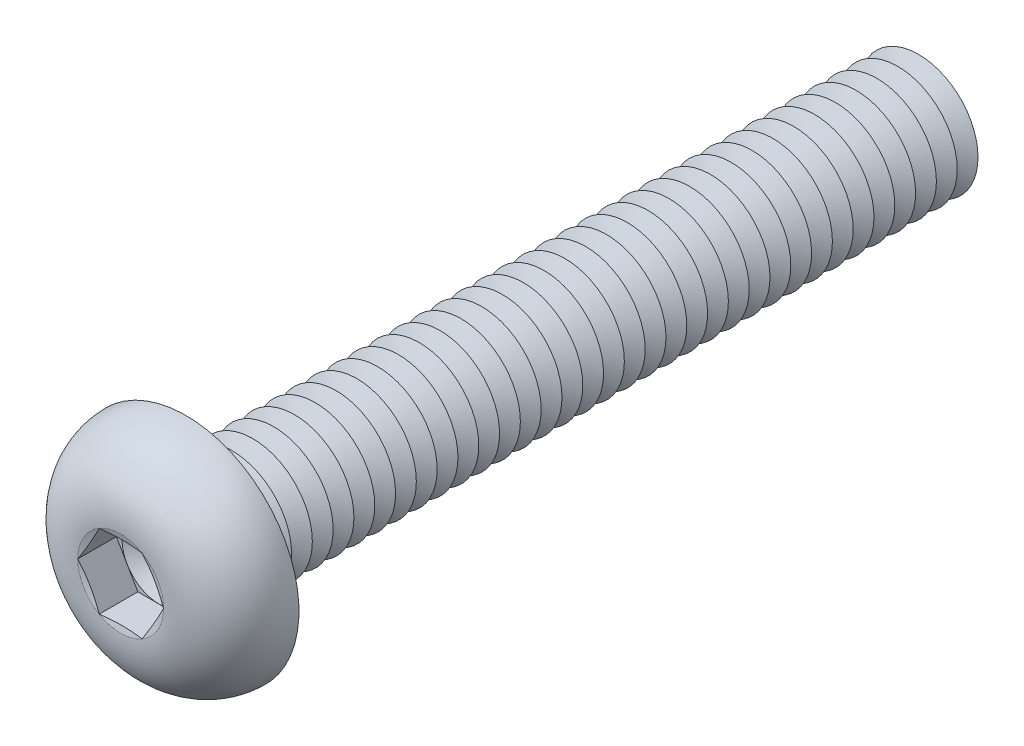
ISO-10303-21;
HEADER;
FILE_DESCRIPTION(('STEP AP214'),'2;1');
FILE_NAME('part.step','',(''),(''),'','','');
FILE_SCHEMA(('AUTOMOTIVE_DESIGN { 1 0 10303 214 1 1 1 1 }'));
ENDSEC;
DATA;
#1=APPLICATION_CONTEXT('core data for automotive mechanical design processes');
#2=APPLICATION_PROTOCOL_DEFINITION('international standard','automotive_design',2000,#1);
#3=PRODUCT_CONTEXT('',#1,'mechanical');
#4=PRODUCT('Part','Part','',(#3));
#5=PRODUCT_RELATED_PRODUCT_CATEGORY('part','',(#4));
#6=PRODUCT_DEFINITION_FORMATION('','',#4);
#7=PRODUCT_DEFINITION_CONTEXT('part definition',#1,'design');
#8=PRODUCT_DEFINITION('design','',#6,#7);
#9=PRODUCT_DEFINITION_SHAPE('','',#8);
#10=(LENGTH_UNIT() NAMED_UNIT(*) SI_UNIT(.MILLI.,.METRE.));
#11=(NAMED_UNIT(*) PLANE_ANGLE_UNIT() SI_UNIT($,.RADIAN.));
#12=(NAMED_UNIT(*) SI_UNIT($,.STERADIAN.) SOLID_ANGLE_UNIT());
#13=UNCERTAINTY_MEASURE_WITH_UNIT(LENGTH_MEASURE(1.E-05),#10,'distance_accuracy_value','');
#14=(GEOMETRIC_REPRESENTATION_CONTEXT(3) GLOBAL_UNCERTAINTY_ASSIGNED_CONTEXT((#13)) GLOBAL_UNIT_ASSIGNED_CONTEXT((#10,
#11,#12)) REPRESENTATION_CONTEXT('',''));
#15=CARTESIAN_POINT('',(0.,0.,0.));
#16=DIRECTION('',(0.,0.,1.));
#17=DIRECTION('',(1.,0.,0.));
#18=AXIS2_PLACEMENT_3D('',#15,#16,#17);
#19=CARTESIAN_POINT('',(0.,0.,0.9));
#20=DIRECTION('',(0.,0.,1.));
#21=DIRECTION('',(1.,0.,0.));
#22=AXIS2_PLACEMENT_3D('',#19,#20,#21);
#23=PLANE('',#22);
#24=CARTESIAN_POINT('',(0.,0.,0.9));
#25=DIRECTION('',(0.,0.,1.));
#26=DIRECTION('',(1.,0.,0.));
#27=AXIS2_PLACEMENT_3D('',#24,#25,#26);
#28=CIRCLE('',#27,1.24999941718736);
#29=CARTESIAN_POINT('',(1.08253125,0.624999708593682,0.9));
#30=VERTEX_POINT('',#29);
#31=CARTESIAN_POINT('',(0.,1.24999941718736,0.9));
#32=VERTEX_POINT('',#31);
#33=EDGE_CURVE('E118',#30,#32,#28,.T.);
#34=ORIENTED_EDGE('',*,*,#33,.F.);
#35=DIRECTION('',(-0.5,0.866025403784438,0.));
#36=VECTOR('',#35,1.);
#37=CARTESIAN_POINT('',(1.443375,0.,0.9));
#38=LINE('',#37,#36);
#39=CARTESIAN_POINT('',(0.7216875,1.24999941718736,0.9));
#40=VERTEX_POINT('',#39);
#41=EDGE_CURVE('E125',#30,#40,#38,.T.);
#42=ORIENTED_EDGE('',*,*,#41,.T.);
#43=DIRECTION('',(-1.,0.,0.));
#44=VECTOR('',#43,1.);
#45=CARTESIAN_POINT('',(0.7216875,1.24999941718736,0.9));
#46=LINE('',#45,#44);
#47=EDGE_CURVE('E136',#40,#32,#46,.T.);
#48=ORIENTED_EDGE('',*,*,#47,.T.);
#49=EDGE_LOOP('',(#34,#42,#48));
#50=FACE_BOUND('',#49,.T.);
#51=ADVANCED_FACE('F39',(#50),#23,.T.);
#52=CARTESIAN_POINT('',(0.,0.,0.9));
#53=DIRECTION('',(0.,0.,1.));
#54=DIRECTION('',(1.,0.,0.));
#55=AXIS2_PLACEMENT_3D('',#52,#53,#54);
#56=CIRCLE('',#55,1.24999941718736);
#57=CARTESIAN_POINT('',(-1.08253125,0.624999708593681,0.9));
#58=VERTEX_POINT('',#57);
#59=EDGE_CURVE('E11',#32,#58,#56,.T.);
#60=ORIENTED_EDGE('',*,*,#59,.F.);
#61=CARTESIAN_POINT('',(-0.721687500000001,1.24999941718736,0.9));
#62=VERTEX_POINT('',#61);
#63=EDGE_CURVE('E131',#32,#62,#46,.T.);
#64=ORIENTED_EDGE('',*,*,#63,.T.);
#65=DIRECTION('',(-0.5,-0.866025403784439,0.));
#66=VECTOR('',#65,1.);
#67=CARTESIAN_POINT('',(-0.721687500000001,1.24999941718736,0.9));
#68=LINE('',#67,#66);
#69=EDGE_CURVE('E134',#62,#58,#68,.T.);
#70=ORIENTED_EDGE('',*,*,#69,.T.);
#71=EDGE_LOOP('',(#60,#64,#70));
#72=FACE_BOUND('',#71,.T.);
#73=ADVANCED_FACE('F130',(#72),#23,.T.);
#74=CARTESIAN_POINT('',(-1.08253125,-0.624999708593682,0.9));
#75=VERTEX_POINT('',#74);
#76=EDGE_CURVE('E49',#58,#75,#56,.T.);
#77=ORIENTED_EDGE('',*,*,#76,.F.);
#78=CARTESIAN_POINT('',(-1.443375,0.,0.9));
#79=VERTEX_POINT('',#78);
#80=EDGE_CURVE('E143',#58,#79,#68,.T.);
#81=ORIENTED_EDGE('',*,*,#80,.T.);
#82=DIRECTION('',(0.5,-0.866025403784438,0.));
#83=VECTOR('',#82,1.);
#84=CARTESIAN_POINT('',(-1.443375,0.,0.9));
#85=LINE('',#84,#83);
#86=EDGE_CURVE('E151',#79,#75,#85,.T.);
#87=ORIENTED_EDGE('',*,*,#86,.T.);
#88=EDGE_LOOP('',(#77,#81,#87));
#89=FACE_BOUND('',#88,.T.);
#90=ADVANCED_FACE('F554',(#89),#23,.T.);
#91=CARTESIAN_POINT('',(0.,-1.24999941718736,0.9));
#92=VERTEX_POINT('',#91);
#93=EDGE_CURVE('E536',#75,#92,#56,.T.);
#94=ORIENTED_EDGE('',*,*,#93,.F.);
#95=CARTESIAN_POINT('',(-0.721687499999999,-1.24999941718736,0.9));
#96=VERTEX_POINT('',#95);
#97=EDGE_CURVE('E150',#75,#96,#85,.T.);
#98=ORIENTED_EDGE('',*,*,#97,.T.);
#99=DIRECTION('',(1.,0.,0.));
#100=VECTOR('',#99,1.);
#101=CARTESIAN_POINT('',(-0.721687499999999,-1.24999941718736,0.9));
#102=LINE('',#101,#100);
#103=EDGE_CURVE('E156',#96,#92,#102,.T.);
#104=ORIENTED_EDGE('',*,*,#103,.T.);
#105=EDGE_LOOP('',(#94,#98,#104));
#106=FACE_BOUND('',#105,.T.);
#107=ADVANCED_FACE('F547',(#106),#23,.T.);
#108=CARTESIAN_POINT('',(1.08253125,-0.624999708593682,0.9));
#109=VERTEX_POINT('',#108);
#110=EDGE_CURVE('E56',#92,#109,#56,.T.);
#111=ORIENTED_EDGE('',*,*,#110,.F.);
#112=CARTESIAN_POINT('',(0.721687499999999,-1.24999941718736,0.9));
#113=VERTEX_POINT('',#112);
#114=EDGE_CURVE('E155',#92,#113,#102,.T.);
#115=ORIENTED_EDGE('',*,*,#114,.T.);
#116=DIRECTION('',(0.5,0.866025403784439,0.));
#117=VECTOR('',#116,1.);
#118=CARTESIAN_POINT('',(0.721687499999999,-1.24999941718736,0.9));
#119=LINE('',#118,#117);
#120=EDGE_CURVE('E161',#113,#109,#119,.T.);
#121=ORIENTED_EDGE('',*,*,#120,.T.);
#122=EDGE_LOOP('',(#111,#115,#121));
#123=FACE_BOUND('',#122,.T.);
#124=ADVANCED_FACE('F627',(#123),#23,.T.);
#125=CARTESIAN_POINT('',(0.,0.,2.2));
#126=DIRECTION('',(0.,0.,1.));
#127=DIRECTION('',(1.,0.,0.));
#128=AXIS2_PLACEMENT_3D('',#125,#126,#127);
#129=CONICAL_SURFACE('',#128,1.443375,1.30899693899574);
#130=CARTESIAN_POINT('',(1.44349047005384,-0.000199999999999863,2.20003094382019));
#131=CARTESIAN_POINT('',(1.41351104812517,0.0517258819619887,2.19199301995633));
#132=CARTESIAN_POINT('',(1.38347725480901,0.10374593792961,2.18469579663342));
#133=CARTESIAN_POINT('',(1.32330355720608,0.207969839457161,2.17187512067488));
#134=CARTESIAN_POINT('',(1.29316361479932,0.260173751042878,2.16635238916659));
#135=CARTESIAN_POINT('',(1.23296043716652,0.364448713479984,2.15740323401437));
#136=CARTESIAN_POINT('',(1.20289760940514,0.416519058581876,2.15396613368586));
#137=CARTESIAN_POINT('',(1.14273359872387,0.520726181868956,2.14935732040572));
#138=CARTESIAN_POINT('',(1.11263242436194,0.572862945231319,2.14818516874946));
#139=CARTESIAN_POINT('',(1.05243007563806,0.677136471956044,2.14818516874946));
#140=CARTESIAN_POINT('',(1.02232890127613,0.729273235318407,2.14935732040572));
#141=CARTESIAN_POINT('',(0.962164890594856,0.833480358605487,2.15396613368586));
#142=CARTESIAN_POINT('',(0.932102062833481,0.885550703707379,2.15740323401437));
#143=CARTESIAN_POINT('',(0.87189888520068,0.989825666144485,2.16635238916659));
#144=CARTESIAN_POINT('',(0.841758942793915,1.0420295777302,2.17187512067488));
#145=CARTESIAN_POINT('',(0.781585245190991,1.14625347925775,2.18469579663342));
#146=CARTESIAN_POINT('',(0.751551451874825,1.19827353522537,2.19199301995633));
#147=CARTESIAN_POINT('',(0.721572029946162,1.25019941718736,2.20003094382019));
#148=B_SPLINE_CURVE_WITH_KNOTS('',3,(#130,#131,#132,#133,#134,#135,#136,#137,#138,#139,#140,
#141,#142,#143,#144,#145,#146,#147),.UNSPECIFIED.,.F.,.F.,(4,2,2,2,2,2,2,2,4),(0.,
0.181495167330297,0.363063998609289,0.543695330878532,0.724291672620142,0.904888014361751,
1.08551934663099,1.26708817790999,1.44858334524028),.UNSPECIFIED.);
#149=CARTESIAN_POINT('',(1.443375,0.,2.2));
#150=VERTEX_POINT('',#149);
#151=CARTESIAN_POINT('',(0.721687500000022,1.24999941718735,2.2));
#152=VERTEX_POINT('',#151);
#153=EDGE_CURVE('E221',#150,#152,#148,.T.);
#154=ORIENTED_EDGE('',*,*,#153,.F.);
#155=CARTESIAN_POINT('',(0.,0.,2.2));
#156=DIRECTION('',(0.,0.,-1.));
#157=DIRECTION('',(-1.,0.,0.));
#158=AXIS2_PLACEMENT_3D('',#155,#156,#157);
#159=CIRCLE('',#158,1.443375);
#160=EDGE_CURVE('E584',#152,#150,#159,.T.);
#161=ORIENTED_EDGE('',*,*,#160,.F.);
#162=EDGE_LOOP('',(#154,#161));
#163=FACE_BOUND('',#162,.T.);
#164=ADVANCED_FACE('F631',(#163),#129,.F.);
#165=CARTESIAN_POINT('',(0.721572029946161,-1.25019941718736,2.20003094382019));
#166=CARTESIAN_POINT('',(0.751551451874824,-1.19827353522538,2.19199301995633));
#167=CARTESIAN_POINT('',(0.78158524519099,-1.14625347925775,2.18469579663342));
#168=CARTESIAN_POINT('',(0.841758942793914,-1.0420295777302,2.17187512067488));
#169=CARTESIAN_POINT('',(0.87189888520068,-0.989825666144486,2.16635238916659));
#170=CARTESIAN_POINT('',(0.932102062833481,-0.88555070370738,2.15740323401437));
#171=CARTESIAN_POINT('',(0.962164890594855,-0.833480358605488,2.15396613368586));
#172=CARTESIAN_POINT('',(1.02232890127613,-0.729273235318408,2.14935732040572));
#173=CARTESIAN_POINT('',(1.05243007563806,-0.677136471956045,2.14818516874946));
#174=CARTESIAN_POINT('',(1.11263242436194,-0.572862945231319,2.14818516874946));
#175=CARTESIAN_POINT('',(1.14273359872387,-0.520726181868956,2.14935732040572));
#176=CARTESIAN_POINT('',(1.20289760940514,-0.416519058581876,2.15396613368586));
#177=CARTESIAN_POINT('',(1.23296043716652,-0.364448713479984,2.15740323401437));
#178=CARTESIAN_POINT('',(1.29316361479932,-0.260173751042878,2.16635238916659));
#179=CARTESIAN_POINT('',(1.32330355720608,-0.207969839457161,2.17187512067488));
#180=CARTESIAN_POINT('',(1.38347725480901,-0.10374593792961,2.18469579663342));
#181=CARTESIAN_POINT('',(1.41351104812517,-0.0517258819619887,2.19199301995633));
#182=CARTESIAN_POINT('',(1.44349047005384,0.000199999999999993,2.20003094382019));
#183=B_SPLINE_CURVE_WITH_KNOTS('',3,(#165,#166,#167,#168,#169,#170,#171,#172,#173,#174,#175,
#176,#177,#178,#179,#180,#181,#182),.UNSPECIFIED.,.F.,.F.,(4,2,2,2,2,2,2,2,4),(0.,
0.181495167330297,0.36306399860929,0.543695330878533,0.724291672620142,0.904888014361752,
1.085519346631,1.26708817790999,1.44858334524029),.UNSPECIFIED.);
#184=CARTESIAN_POINT('',(0.721687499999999,-1.24999941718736,2.2));
#185=VERTEX_POINT('',#184);
#186=EDGE_CURVE('E230',#185,#150,#183,.T.);
#187=ORIENTED_EDGE('',*,*,#186,.F.);
#188=EDGE_CURVE('E586',#150,#185,#159,.T.);
#189=ORIENTED_EDGE('',*,*,#188,.F.);
#190=EDGE_LOOP('',(#187,#189));
#191=FACE_BOUND('',#190,.T.);
#192=ADVANCED_FACE('F592',(#191),#129,.F.);
#193=CARTESIAN_POINT('',(-2.17815859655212,-1.24999941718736,2.48616275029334));
#194=CARTESIAN_POINT('',(-2.07269794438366,-1.24999941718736,2.4616881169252));
#195=CARTESIAN_POINT('',(-1.96714913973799,-1.24999941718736,2.43756889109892));
#196=CARTESIAN_POINT('',(-1.75576352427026,-1.24999941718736,2.39052699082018));
#197=CARTESIAN_POINT('',(-1.64992665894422,-1.24999941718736,2.36760456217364));
#198=CARTESIAN_POINT('',(-1.43690237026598,-1.24999941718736,2.3232454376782));
#199=CARTESIAN_POINT('',(-1.32971158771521,-1.24999941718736,2.30182468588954));
#200=CARTESIAN_POINT('',(-1.1148274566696,-1.24999941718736,2.26156703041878));
#201=CARTESIAN_POINT('',(-1.00713406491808,-1.24999941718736,2.24273035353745));
#202=CARTESIAN_POINT('',(-0.794044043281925,-1.24999941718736,2.2093913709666));
#203=CARTESIAN_POINT('',(-0.688664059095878,-1.24999941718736,2.19478562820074));
#204=CARTESIAN_POINT('',(-0.477310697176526,-1.24999941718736,2.17085809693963));
#205=CARTESIAN_POINT('',(-0.371337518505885,-1.24999941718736,2.16153463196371));
#206=CARTESIAN_POINT('',(-0.159455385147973,-1.24999941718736,2.14976770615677));
#207=CARTESIAN_POINT('',(-0.0535482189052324,-1.24999941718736,2.14729400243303));
#208=CARTESIAN_POINT('',(0.158189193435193,-1.24999941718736,2.14966287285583));
#209=CARTESIAN_POINT('',(0.264019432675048,-1.24999941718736,2.15450603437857));
#210=CARTESIAN_POINT('',(0.445148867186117,-1.24999941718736,2.16825380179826));
#211=CARTESIAN_POINT('',(0.520574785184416,-1.24999941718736,2.17561242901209));
#212=CARTESIAN_POINT('',(0.671115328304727,-1.24999941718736,2.19297000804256));
#213=CARTESIAN_POINT('',(0.746229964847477,-1.24999941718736,2.20296886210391));
#214=CARTESIAN_POINT('',(0.896387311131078,-1.24999941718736,2.22505910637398));
#215=CARTESIAN_POINT('',(0.971429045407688,-1.24999941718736,2.23715700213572));
#216=CARTESIAN_POINT('',(1.12124320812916,-1.24999941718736,2.26292371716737));
#217=CARTESIAN_POINT('',(1.19601562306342,-1.24999941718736,2.27659261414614));
#218=CARTESIAN_POINT('',(1.34686913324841,-1.24999941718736,2.30540811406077));
#219=CARTESIAN_POINT('',(1.42294548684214,-1.24999941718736,2.32057934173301));
#220=CARTESIAN_POINT('',(1.57490676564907,-1.24999941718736,2.351851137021));
#221=CARTESIAN_POINT('',(1.65079168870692,-1.24999941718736,2.36795171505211));
#222=CARTESIAN_POINT('',(1.80199501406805,-1.24999941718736,2.40076814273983));
#223=CARTESIAN_POINT('',(1.87731425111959,-1.24999941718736,2.41748016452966));
#224=CARTESIAN_POINT('',(2.02782424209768,-1.24999941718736,2.45144971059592));
#225=CARTESIAN_POINT('',(2.10301500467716,-1.24999941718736,2.46870719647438));
#226=CARTESIAN_POINT('',(2.17815859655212,-1.24999941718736,2.48616275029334));
#227=B_SPLINE_CURVE_WITH_KNOTS('',3,(#193,#194,#195,#196,#197,#198,#199,#200,#201,#202,#203,
#204,#205,#206,#207,#208,#209,#210,#211,#212,#213,#214,#215,#216,#217,#218,#219,#220,#221,#222,
#223,#224,#225,#226),.UNSPECIFIED.,.F.,.F.,(4,2,2,2,2,2,2,2,2,2,2,2,2,2,2,2,4),(0.,
0.324797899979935,0.649662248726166,0.977572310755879,1.30551113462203,1.62458166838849,
1.94355087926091,2.26110952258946,2.57869365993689,2.80599541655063,3.03328875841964,
3.2612995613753,3.48932164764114,3.7220371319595,3.95475522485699,4.18620606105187,
4.41764064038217),.UNSPECIFIED.);
#228=CARTESIAN_POINT('',(-0.721687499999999,-1.24999941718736,2.2));
#229=VERTEX_POINT('',#228);
#230=EDGE_CURVE('E566',#229,#185,#227,.T.);
#231=ORIENTED_EDGE('',*,*,#230,.F.);
#232=EDGE_CURVE('E574',#185,#229,#159,.T.);
#233=ORIENTED_EDGE('',*,*,#232,.F.);
#234=EDGE_LOOP('',(#231,#233));
#235=FACE_BOUND('',#234,.T.);
#236=ADVANCED_FACE('F598',(#235),#129,.F.);
#237=CARTESIAN_POINT('',(-1.44349047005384,0.000200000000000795,2.20003094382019));
#238=CARTESIAN_POINT('',(-1.41351104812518,-0.0517258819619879,2.19199301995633));
#239=CARTESIAN_POINT('',(-1.38347725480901,-0.10374593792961,2.18469579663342));
#240=CARTESIAN_POINT('',(-1.32330355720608,-0.20796983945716,2.17187512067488));
#241=CARTESIAN_POINT('',(-1.29316361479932,-0.260173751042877,2.16635238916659));
#242=CARTESIAN_POINT('',(-1.23296043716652,-0.364448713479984,2.15740323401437));
#243=CARTESIAN_POINT('',(-1.20289760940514,-0.416519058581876,2.15396613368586));
#244=CARTESIAN_POINT('',(-1.14273359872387,-0.520726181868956,2.14935732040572));
#245=CARTESIAN_POINT('',(-1.11263242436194,-0.572862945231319,2.14818516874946));
#246=CARTESIAN_POINT('',(-1.05243007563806,-0.677136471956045,2.14818516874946));
#247=CARTESIAN_POINT('',(-1.02232890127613,-0.729273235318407,2.14935732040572));
#248=CARTESIAN_POINT('',(-0.962164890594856,-0.833480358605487,2.15396613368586));
#249=CARTESIAN_POINT('',(-0.932102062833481,-0.885550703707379,2.15740323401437));
#250=CARTESIAN_POINT('',(-0.87189888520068,-0.989825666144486,2.16635238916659));
#251=CARTESIAN_POINT('',(-0.841758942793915,-1.0420295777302,2.17187512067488));
#252=CARTESIAN_POINT('',(-0.78158524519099,-1.14625347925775,2.18469579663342));
#253=CARTESIAN_POINT('',(-0.751551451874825,-1.19827353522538,2.19199301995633));
#254=CARTESIAN_POINT('',(-0.721572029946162,-1.25019941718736,2.20003094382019));
#255=B_SPLINE_CURVE_WITH_KNOTS('',3,(#237,#238,#239,#240,#241,#242,#243,#244,#245,#246,#247,
#248,#249,#250,#251,#252,#253,#254),.UNSPECIFIED.,.F.,.F.,(4,2,2,2,2,2,2,2,4),(0.,
0.181495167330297,0.36306399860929,0.543695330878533,0.724291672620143,0.904888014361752,
1.085519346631,1.26708817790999,1.44858334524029),.UNSPECIFIED.);
#256=CARTESIAN_POINT('',(-1.443375,0.,2.2));
#257=VERTEX_POINT('',#256);
#258=EDGE_CURVE('E559',#257,#229,#255,.T.);
#259=ORIENTED_EDGE('',*,*,#258,.F.);
#260=EDGE_CURVE('E516',#229,#257,#159,.T.);
#261=ORIENTED_EDGE('',*,*,#260,.F.);
#262=EDGE_LOOP('',(#259,#261));
#263=FACE_BOUND('',#262,.T.);
#264=ADVANCED_FACE('F563',(#263),#129,.F.);
#265=CARTESIAN_POINT('',(-0.721572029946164,1.25019941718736,2.20003094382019));
#266=CARTESIAN_POINT('',(-0.751551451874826,1.19827353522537,2.19199301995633));
#267=CARTESIAN_POINT('',(-0.781585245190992,1.14625347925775,2.18469579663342));
#268=CARTESIAN_POINT('',(-0.841758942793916,1.0420295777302,2.17187512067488));
#269=CARTESIAN_POINT('',(-0.871898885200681,0.989825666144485,2.16635238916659));
#270=CARTESIAN_POINT('',(-0.932102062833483,0.885550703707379,2.15740323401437));
#271=CARTESIAN_POINT('',(-0.962164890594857,0.833480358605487,2.15396613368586));
#272=CARTESIAN_POINT('',(-1.02232890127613,0.729273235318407,2.14935732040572));
#273=CARTESIAN_POINT('',(-1.05243007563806,0.677136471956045,2.14818516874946));
#274=CARTESIAN_POINT('',(-1.11263242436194,0.572862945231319,2.14818516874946));
#275=CARTESIAN_POINT('',(-1.14273359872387,0.520726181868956,2.14935732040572));
#276=CARTESIAN_POINT('',(-1.20289760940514,0.416519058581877,2.15396613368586));
#277=CARTESIAN_POINT('',(-1.23296043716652,0.364448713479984,2.15740323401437));
#278=CARTESIAN_POINT('',(-1.29316361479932,0.260173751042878,2.16635238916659));
#279=CARTESIAN_POINT('',(-1.32330355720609,0.207969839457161,2.17187512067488));
#280=CARTESIAN_POINT('',(-1.38347725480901,0.103745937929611,2.18469579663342));
#281=CARTESIAN_POINT('',(-1.41351104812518,0.0517258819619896,2.19199301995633));
#282=CARTESIAN_POINT('',(-1.44349047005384,-0.00019999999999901,2.20003094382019));
#283=B_SPLINE_CURVE_WITH_KNOTS('',3,(#265,#266,#267,#268,#269,#270,#271,#272,#273,#274,#275,
#276,#277,#278,#279,#280,#281,#282),.UNSPECIFIED.,.F.,.F.,(4,2,2,2,2,2,2,2,4),(0.,
0.181495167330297,0.363063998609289,0.543695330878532,0.724291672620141,0.90488801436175,
1.08551934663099,1.26708817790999,1.44858334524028),.UNSPECIFIED.);
#284=CARTESIAN_POINT('',(-0.721687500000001,1.24999941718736,2.2));
#285=VERTEX_POINT('',#284);
#286=EDGE_CURVE('E194',#285,#257,#283,.T.);
#287=ORIENTED_EDGE('',*,*,#286,.F.);
#288=EDGE_CURVE('E517',#257,#285,#159,.T.);
#289=ORIENTED_EDGE('',*,*,#288,.F.);
#290=EDGE_LOOP('',(#287,#289));
#291=FACE_BOUND('',#290,.T.);
#292=ADVANCED_FACE('F577',(#291),#129,.F.);
#293=CARTESIAN_POINT('',(0.,0.,-22.55));
#294=DIRECTION('',(0.,0.,1.));
#295=DIRECTION('',(1.,0.,0.));
#296=AXIS2_PLACEMENT_3D('',#293,#294,#295);
#297=CONICAL_SURFACE('',#296,2.00000000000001,1.0471975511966);
#298=CARTESIAN_POINT('',(0.,0.,-22.9));
#299=DIRECTION('',(0.,0.,1.));
#300=DIRECTION('',(1.,0.,0.));
#301=AXIS2_PLACEMENT_3D('',#298,#299,#300);
#302=CIRCLE('',#301,1.3937822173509);
#303=CARTESIAN_POINT('',(1.3937822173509,0.,-22.9));
#304=VERTEX_POINT('',#303);
#305=EDGE_CURVE('E488',#304,#304,#302,.T.);
#306=ORIENTED_EDGE('',*,*,#305,.T.);
#307=EDGE_LOOP('',(#306));
#308=FACE_BOUND('',#307,.T.);
#309=CARTESIAN_POINT('',(0.,0.,-22.55));
#310=DIRECTION('',(0.,0.,1.));
#311=DIRECTION('',(1.,0.,0.));
#312=AXIS2_PLACEMENT_3D('',#309,#310,#311);
#313=CIRCLE('',#312,2.00000000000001);
#314=CARTESIAN_POINT('',(2.00000000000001,0.,-22.55));
#315=VERTEX_POINT('',#314);
#316=EDGE_CURVE('E484',#315,#315,#313,.T.);
#317=ORIENTED_EDGE('',*,*,#316,.F.);
#318=EDGE_LOOP('',(#317));
#319=FACE_BOUND('',#318,.T.);
#320=ADVANCED_FACE('F763',(#308,#319),#297,.T.);
#321=CARTESIAN_POINT('',(0.,0.,-22.9));
#322=DIRECTION('',(0.,0.,-1.));
#323=DIRECTION('',(-1.,0.,0.));
#324=AXIS2_PLACEMENT_3D('',#321,#322,#323);
#325=CONICAL_SURFACE('',#324,1.3937822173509,1.0471975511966);
#326=CARTESIAN_POINT('',(0.,0.,-23.25));
#327=DIRECTION('',(0.,0.,1.));
#328=DIRECTION('',(1.,0.,0.));
#329=AXIS2_PLACEMENT_3D('',#326,#327,#328);
#330=CIRCLE('',#329,2.00000000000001);
#331=CARTESIAN_POINT('',(2.00000000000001,0.,-23.25));
#332=VERTEX_POINT('',#331);
#333=EDGE_CURVE('E492',#332,#332,#330,.T.);
#334=ORIENTED_EDGE('',*,*,#333,.T.);
#335=EDGE_LOOP('',(#334));
#336=FACE_BOUND('',#335,.T.);
#337=ORIENTED_EDGE('',*,*,#305,.F.);
#338=EDGE_LOOP('',(#337));
#339=FACE_BOUND('',#338,.T.);
#340=ADVANCED_FACE('F1426',(#336,#339),#325,.T.);
#341=CARTESIAN_POINT('',(0.,2.00000000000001,-25.));
#342=DIRECTION('',(0.,0.,-1.));
#343=DIRECTION('',(-1.,0.,0.));
#344=AXIS2_PLACEMENT_3D('',#341,#342,#343);
#345=PLANE('',#344);
#346=CARTESIAN_POINT('',(0.,0.,-25.));
#347=DIRECTION('',(0.,0.,1.));
#348=DIRECTION('',(1.,0.,0.));
#349=AXIS2_PLACEMENT_3D('',#346,#347,#348);
#350=CIRCLE('',#349,1.3937822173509);
#351=CARTESIAN_POINT('',(1.3937822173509,0.,-25.));
#352=VERTEX_POINT('',#351);
#353=EDGE_CURVE('E512',#352,#352,#350,.T.);
#354=ORIENTED_EDGE('',*,*,#353,.F.);
#355=EDGE_LOOP('',(#354));
#356=FACE_BOUND('',#355,.T.);
#357=ADVANCED_FACE('F1431',(#356),#345,.T.);
#358=CARTESIAN_POINT('',(0.,0.,-24.65));
#359=DIRECTION('',(0.,0.,1.));
#360=DIRECTION('',(1.,0.,0.));
#361=AXIS2_PLACEMENT_3D('',#358,#359,#360);
#362=CONICAL_SURFACE('',#361,2.00000000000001,1.0471975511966);
#363=ORIENTED_EDGE('',*,*,#353,.T.);
#364=EDGE_LOOP('',(#363));
#365=FACE_BOUND('',#364,.T.);
#366=CARTESIAN_POINT('',(0.,0.,-24.65));
#367=DIRECTION('',(0.,0.,1.));
#368=DIRECTION('',(1.,0.,0.));
#369=AXIS2_PLACEMENT_3D('',#366,#367,#368);
#370=CIRCLE('',#369,2.00000000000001);
#371=CARTESIAN_POINT('',(2.00000000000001,0.,-24.65));
#372=VERTEX_POINT('',#371);
#373=EDGE_CURVE('E508',#372,#372,#370,.T.);
#374=ORIENTED_EDGE('',*,*,#373,.F.);
#375=EDGE_LOOP('',(#374));
#376=FACE_BOUND('',#375,.T.);
#377=ADVANCED_FACE('F1420',(#365,#376),#362,.T.);
#378=CARTESIAN_POINT('',(0.,0.,-24.3));
#379=DIRECTION('',(0.,0.,-1.));
#380=DIRECTION('',(-1.,0.,0.));
#381=AXIS2_PLACEMENT_3D('',#378,#379,#380);
#382=CONICAL_SURFACE('',#381,1.3937822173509,1.0471975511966);
#383=ORIENTED_EDGE('',*,*,#373,.T.);
#384=EDGE_LOOP('',(#383));
#385=FACE_BOUND('',#384,.T.);
#386=CARTESIAN_POINT('',(0.,0.,-24.3));
#387=DIRECTION('',(0.,0.,1.));
#388=DIRECTION('',(1.,0.,0.));
#389=AXIS2_PLACEMENT_3D('',#386,#387,#388);
#390=CIRCLE('',#389,1.3937822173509);
#391=CARTESIAN_POINT('',(1.3937822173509,0.,-24.3));
#392=VERTEX_POINT('',#391);
#393=EDGE_CURVE('E504',#392,#392,#390,.T.);
#394=ORIENTED_EDGE('',*,*,#393,.F.);
#395=EDGE_LOOP('',(#394));
#396=FACE_BOUND('',#395,.T.);
#397=ADVANCED_FACE('F1410',(#385,#396),#382,.T.);
#398=CARTESIAN_POINT('',(0.,0.,-23.95));
#399=DIRECTION('',(0.,0.,1.));
#400=DIRECTION('',(1.,0.,0.));
#401=AXIS2_PLACEMENT_3D('',#398,#399,#400);
#402=CONICAL_SURFACE('',#401,2.00000000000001,1.0471975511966);
#403=ORIENTED_EDGE('',*,*,#393,.T.);
#404=EDGE_LOOP('',(#403));
#405=FACE_BOUND('',#404,.T.);
#406=CARTESIAN_POINT('',(0.,0.,-23.95));
#407=DIRECTION('',(0.,0.,1.));
#408=DIRECTION('',(1.,0.,0.));
#409=AXIS2_PLACEMENT_3D('',#406,#407,#408);
#410=CIRCLE('',#409,2.00000000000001);
#411=CARTESIAN_POINT('',(2.00000000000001,0.,-23.95));
#412=VERTEX_POINT('',#411);
#413=EDGE_CURVE('E500',#412,#412,#410,.T.);
#414=ORIENTED_EDGE('',*,*,#413,.F.);
#415=EDGE_LOOP('',(#414));
#416=FACE_BOUND('',#415,.T.);
#417=ADVANCED_FACE('F1400',(#405,#416),#402,.T.);
#418=CARTESIAN_POINT('',(0.,0.,-23.6));
#419=DIRECTION('',(0.,0.,-1.));
#420=DIRECTION('',(-1.,0.,0.));
#421=AXIS2_PLACEMENT_3D('',#418,#419,#420);
#422=CONICAL_SURFACE('',#421,1.3937822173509,1.0471975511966);
#423=ORIENTED_EDGE('',*,*,#413,.T.);
#424=EDGE_LOOP('',(#423));
#425=FACE_BOUND('',#424,.T.);
#426=CARTESIAN_POINT('',(0.,0.,-23.6));
#427=DIRECTION('',(0.,0.,1.));
#428=DIRECTION('',(1.,0.,0.));
#429=AXIS2_PLACEMENT_3D('',#426,#427,#428);
#430=CIRCLE('',#429,1.3937822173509);
#431=CARTESIAN_POINT('',(1.3937822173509,0.,-23.6));
#432=VERTEX_POINT('',#431);
#433=EDGE_CURVE('E496',#432,#432,#430,.T.);
#434=ORIENTED_EDGE('',*,*,#433,.F.);
#435=EDGE_LOOP('',(#434));
#436=FACE_BOUND('',#435,.T.);
#437=ADVANCED_FACE('F1390',(#425,#436),#422,.T.);
#438=CARTESIAN_POINT('',(0.,0.,-23.25));
#439=DIRECTION('',(0.,0.,1.));
#440=DIRECTION('',(1.,0.,0.));
#441=AXIS2_PLACEMENT_3D('',#438,#439,#440);
#442=CONICAL_SURFACE('',#441,2.00000000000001,1.0471975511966);
#443=ORIENTED_EDGE('',*,*,#433,.T.);
#444=EDGE_LOOP('',(#443));
#445=FACE_BOUND('',#444,.T.);
#446=ORIENTED_EDGE('',*,*,#333,.F.);
#447=EDGE_LOOP('',(#446));
#448=FACE_BOUND('',#447,.T.);
#449=ADVANCED_FACE('F1380',(#445,#448),#442,.T.);
#450=CARTESIAN_POINT('',(0.,0.,-21.85));
#451=DIRECTION('',(0.,0.,1.));
#452=DIRECTION('',(1.,0.,0.));
#453=AXIS2_PLACEMENT_3D('',#450,#451,#452);
#454=CONICAL_SURFACE('',#453,2.00000000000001,1.0471975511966);
#455=CARTESIAN_POINT('',(0.,0.,-22.2));
#456=DIRECTION('',(0.,0.,1.));
#457=DIRECTION('',(1.,0.,0.));
#458=AXIS2_PLACEMENT_3D('',#455,#456,#457);
#459=CIRCLE('',#458,1.3937822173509);
#460=CARTESIAN_POINT('',(1.3937822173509,0.,-22.2));
#461=VERTEX_POINT('',#460);
#462=EDGE_CURVE('E480',#461,#461,#459,.T.);
#463=ORIENTED_EDGE('',*,*,#462,.T.);
#464=EDGE_LOOP('',(#463));
#465=FACE_BOUND('',#464,.T.);
#466=CARTESIAN_POINT('',(0.,0.,-21.85));
#467=DIRECTION('',(0.,0.,1.));
#468=DIRECTION('',(1.,0.,0.));
#469=AXIS2_PLACEMENT_3D('',#466,#467,#468);
#470=CIRCLE('',#469,2.00000000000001);
#471=CARTESIAN_POINT('',(2.00000000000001,0.,-21.85));
#472=VERTEX_POINT('',#471);
#473=EDGE_CURVE('E476',#472,#472,#470,.T.);
#474=ORIENTED_EDGE('',*,*,#473,.F.);
#475=EDGE_LOOP('',(#474));
#476=FACE_BOUND('',#475,.T.);
#477=ADVANCED_FACE('F1370',(#465,#476),#454,.T.);
#478=CARTESIAN_POINT('',(0.,0.,-22.2));
#479=DIRECTION('',(0.,0.,-1.));
#480=DIRECTION('',(-1.,0.,0.));
#481=AXIS2_PLACEMENT_3D('',#478,#479,#480);
#482=CONICAL_SURFACE('',#481,1.3937822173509,1.0471975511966);
#483=ORIENTED_EDGE('',*,*,#316,.T.);
#484=EDGE_LOOP('',(#483));
#485=FACE_BOUND('',#484,.T.);
#486=ORIENTED_EDGE('',*,*,#462,.F.);
#487=EDGE_LOOP('',(#486));
#488=FACE_BOUND('',#487,.T.);
#489=ADVANCED_FACE('F1360',(#485,#488),#482,.T.);
#490=CARTESIAN_POINT('',(0.,0.,-21.15));
#491=DIRECTION('',(0.,0.,1.));
#492=DIRECTION('',(1.,0.,0.));
#493=AXIS2_PLACEMENT_3D('',#490,#491,#492);
#494=CONICAL_SURFACE('',#493,2.00000000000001,1.0471975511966);
#495=CARTESIAN_POINT('',(0.,0.,-21.5));
#496=DIRECTION('',(0.,0.,1.));
#497=DIRECTION('',(1.,0.,0.));
#498=AXIS2_PLACEMENT_3D('',#495,#496,#497);
#499=CIRCLE('',#498,1.3937822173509);
#500=CARTESIAN_POINT('',(1.3937822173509,0.,-21.5));
#501=VERTEX_POINT('',#500);
#502=EDGE_CURVE('E472',#501,#501,#499,.T.);
#503=ORIENTED_EDGE('',*,*,#502,.T.);
#504=EDGE_LOOP('',(#503));
#505=FACE_BOUND('',#504,.T.);
#506=CARTESIAN_POINT('',(0.,0.,-21.15));
#507=DIRECTION('',(0.,0.,1.));
#508=DIRECTION('',(1.,0.,0.));
#509=AXIS2_PLACEMENT_3D('',#506,#507,#508);
#510=CIRCLE('',#509,2.00000000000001);
#511=CARTESIAN_POINT('',(2.00000000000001,0.,-21.15));
#512=VERTEX_POINT('',#511);
#513=EDGE_CURVE('E468',#512,#512,#510,.T.);
#514=ORIENTED_EDGE('',*,*,#513,.F.);
#515=EDGE_LOOP('',(#514));
#516=FACE_BOUND('',#515,.T.);
#517=ADVANCED_FACE('F1350',(#505,#516),#494,.T.);
#518=CARTESIAN_POINT('',(0.,0.,-21.5));
#519=DIRECTION('',(0.,0.,-1.));
#520=DIRECTION('',(-1.,0.,0.));
#521=AXIS2_PLACEMENT_3D('',#518,#519,#520);
#522=CONICAL_SURFACE('',#521,1.3937822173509,1.0471975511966);
#523=ORIENTED_EDGE('',*,*,#473,.T.);
#524=EDGE_LOOP('',(#523));
#525=FACE_BOUND('',#524,.T.);
#526=ORIENTED_EDGE('',*,*,#502,.F.);
#527=EDGE_LOOP('',(#526));
#528=FACE_BOUND('',#527,.T.);
#529=ADVANCED_FACE('F1340',(#525,#528),#522,.T.);
#530=CARTESIAN_POINT('',(0.,0.,-20.45));
#531=DIRECTION('',(0.,0.,1.));
#532=DIRECTION('',(1.,0.,0.));
#533=AXIS2_PLACEMENT_3D('',#530,#531,#532);
#534=CONICAL_SURFACE('',#533,2.00000000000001,1.0471975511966);
#535=CARTESIAN_POINT('',(0.,0.,-20.8));
#536=DIRECTION('',(0.,0.,1.));
#537=DIRECTION('',(1.,0.,0.));
#538=AXIS2_PLACEMENT_3D('',#535,#536,#537);
#539=CIRCLE('',#538,1.3937822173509);
#540=CARTESIAN_POINT('',(1.3937822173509,0.,-20.8));
#541=VERTEX_POINT('',#540);
#542=EDGE_CURVE('E464',#541,#541,#539,.T.);
#543=ORIENTED_EDGE('',*,*,#542,.T.);
#544=EDGE_LOOP('',(#543));
#545=FACE_BOUND('',#544,.T.);
#546=CARTESIAN_POINT('',(0.,0.,-20.45));
#547=DIRECTION('',(0.,0.,1.));
#548=DIRECTION('',(1.,0.,0.));
#549=AXIS2_PLACEMENT_3D('',#546,#547,#548);
#550=CIRCLE('',#549,2.00000000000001);
#551=CARTESIAN_POINT('',(2.00000000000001,0.,-20.45));
#552=VERTEX_POINT('',#551);
#553=EDGE_CURVE('E460',#552,#552,#550,.T.);
#554=ORIENTED_EDGE('',*,*,#553,.F.);
#555=EDGE_LOOP('',(#554));
#556=FACE_BOUND('',#555,.T.);
#557=ADVANCED_FACE('F1330',(#545,#556),#534,.T.);
#558=CARTESIAN_POINT('',(0.,0.,-20.8));
#559=DIRECTION('',(0.,0.,-1.));
#560=DIRECTION('',(-1.,0.,0.));
#561=AXIS2_PLACEMENT_3D('',#558,#559,#560);
#562=CONICAL_SURFACE('',#561,1.3937822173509,1.0471975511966);
#563=ORIENTED_EDGE('',*,*,#513,.T.);
#564=EDGE_LOOP('',(#563));
#565=FACE_BOUND('',#564,.T.);
#566=ORIENTED_EDGE('',*,*,#542,.F.);
#567=EDGE_LOOP('',(#566));
#568=FACE_BOUND('',#567,.T.);
#569=ADVANCED_FACE('F1320',(#565,#568),#562,.T.);
#570=CARTESIAN_POINT('',(0.,0.,-19.75));
#571=DIRECTION('',(0.,0.,1.));
#572=DIRECTION('',(1.,0.,0.));
#573=AXIS2_PLACEMENT_3D('',#570,#571,#572);
#574=CONICAL_SURFACE('',#573,2.00000000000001,1.0471975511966);
#575=CARTESIAN_POINT('',(0.,0.,-20.1));
#576=DIRECTION('',(0.,0.,1.));
#577=DIRECTION('',(1.,0.,0.));
#578=AXIS2_PLACEMENT_3D('',#575,#576,#577);
#579=CIRCLE('',#578,1.3937822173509);
#580=CARTESIAN_POINT('',(1.3937822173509,0.,-20.1));
#581=VERTEX_POINT('',#580);
#582=EDGE_CURVE('E456',#581,#581,#579,.T.);
#583=ORIENTED_EDGE('',*,*,#582,.T.);
#584=EDGE_LOOP('',(#583));
#585=FACE_BOUND('',#584,.T.);
#586=CARTESIAN_POINT('',(0.,0.,-19.75));
#587=DIRECTION('',(0.,0.,1.));
#588=DIRECTION('',(1.,0.,0.));
#589=AXIS2_PLACEMENT_3D('',#586,#587,#588);
#590=CIRCLE('',#589,2.00000000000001);
#591=CARTESIAN_POINT('',(2.00000000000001,0.,-19.75));
#592=VERTEX_POINT('',#591);
#593=EDGE_CURVE('E452',#592,#592,#590,.T.);
#594=ORIENTED_EDGE('',*,*,#593,.F.);
#595=EDGE_LOOP('',(#594));
#596=FACE_BOUND('',#595,.T.);
#597=ADVANCED_FACE('F1310',(#585,#596),#574,.T.);
#598=CARTESIAN_POINT('',(0.,0.,-20.1));
#599=DIRECTION('',(0.,0.,-1.));
#600=DIRECTION('',(-1.,0.,0.));
#601=AXIS2_PLACEMENT_3D('',#598,#599,#600);
#602=CONICAL_SURFACE('',#601,1.3937822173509,1.0471975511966);
#603=ORIENTED_EDGE('',*,*,#553,.T.);
#604=EDGE_LOOP('',(#603));
#605=FACE_BOUND('',#604,.T.);
#606=ORIENTED_EDGE('',*,*,#582,.F.);
#607=EDGE_LOOP('',(#606));
#608=FACE_BOUND('',#607,.T.);
#609=ADVANCED_FACE('F1300',(#605,#608),#602,.T.);
#610=CARTESIAN_POINT('',(0.,0.,-19.05));
#611=DIRECTION('',(0.,0.,1.));
#612=DIRECTION('',(1.,0.,0.));
#613=AXIS2_PLACEMENT_3D('',#610,#611,#612);
#614=CONICAL_SURFACE('',#613,2.00000000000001,1.0471975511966);
#615=CARTESIAN_POINT('',(0.,0.,-19.4));
#616=DIRECTION('',(0.,0.,1.));
#617=DIRECTION('',(1.,0.,0.));
#618=AXIS2_PLACEMENT_3D('',#615,#616,#617);
#619=CIRCLE('',#618,1.3937822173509);
#620=CARTESIAN_POINT('',(1.3937822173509,0.,-19.4));
#621=VERTEX_POINT('',#620);
#622=EDGE_CURVE('E448',#621,#621,#619,.T.);
#623=ORIENTED_EDGE('',*,*,#622,.T.);
#624=EDGE_LOOP('',(#623));
#625=FACE_BOUND('',#624,.T.);
#626=CARTESIAN_POINT('',(0.,0.,-19.05));
#627=DIRECTION('',(0.,0.,1.));
#628=DIRECTION('',(1.,0.,0.));
#629=AXIS2_PLACEMENT_3D('',#626,#627,#628);
#630=CIRCLE('',#629,2.00000000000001);
#631=CARTESIAN_POINT('',(2.00000000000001,0.,-19.05));
#632=VERTEX_POINT('',#631);
#633=EDGE_CURVE('E444',#632,#632,#630,.T.);
#634=ORIENTED_EDGE('',*,*,#633,.F.);
#635=EDGE_LOOP('',(#634));
#636=FACE_BOUND('',#635,.T.);
#637=ADVANCED_FACE('F1290',(#625,#636),#614,.T.);
#638=CARTESIAN_POINT('',(0.,0.,-19.4));
#639=DIRECTION('',(0.,0.,-1.));
#640=DIRECTION('',(-1.,0.,0.));
#641=AXIS2_PLACEMENT_3D('',#638,#639,#640);
#642=CONICAL_SURFACE('',#641,1.3937822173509,1.0471975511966);
#643=ORIENTED_EDGE('',*,*,#593,.T.);
#644=EDGE_LOOP('',(#643));
#645=FACE_BOUND('',#644,.T.);
#646=ORIENTED_EDGE('',*,*,#622,.F.);
#647=EDGE_LOOP('',(#646));
#648=FACE_BOUND('',#647,.T.);
#649=ADVANCED_FACE('F1280',(#645,#648),#642,.T.);
#650=CARTESIAN_POINT('',(0.,0.,-18.35));
#651=DIRECTION('',(0.,0.,1.));
#652=DIRECTION('',(1.,0.,0.));
#653=AXIS2_PLACEMENT_3D('',#650,#651,#652);
#654=CONICAL_SURFACE('',#653,2.00000000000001,1.0471975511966);
#655=CARTESIAN_POINT('',(0.,0.,-18.7));
#656=DIRECTION('',(0.,0.,1.));
#657=DIRECTION('',(1.,0.,0.));
#658=AXIS2_PLACEMENT_3D('',#655,#656,#657);
#659=CIRCLE('',#658,1.3937822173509);
#660=CARTESIAN_POINT('',(1.3937822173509,0.,-18.7));
#661=VERTEX_POINT('',#660);
#662=EDGE_CURVE('E440',#661,#661,#659,.T.);
#663=ORIENTED_EDGE('',*,*,#662,.T.);
#664=EDGE_LOOP('',(#663));
#665=FACE_BOUND('',#664,.T.);
#666=CARTESIAN_POINT('',(0.,0.,-18.35));
#667=DIRECTION('',(0.,0.,1.));
#668=DIRECTION('',(1.,0.,0.));
#669=AXIS2_PLACEMENT_3D('',#666,#667,#668);
#670=CIRCLE('',#669,2.00000000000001);
#671=CARTESIAN_POINT('',(2.00000000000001,0.,-18.35));
#672=VERTEX_POINT('',#671);
#673=EDGE_CURVE('E436',#672,#672,#670,.T.);
#674=ORIENTED_EDGE('',*,*,#673,.F.);
#675=EDGE_LOOP('',(#674));
#676=FACE_BOUND('',#675,.T.);
#677=ADVANCED_FACE('F1270',(#665,#676),#654,.T.);
#678=CARTESIAN_POINT('',(0.,0.,-18.7));
#679=DIRECTION('',(0.,0.,-1.));
#680=DIRECTION('',(-1.,0.,0.));
#681=AXIS2_PLACEMENT_3D('',#678,#679,#680);
#682=CONICAL_SURFACE('',#681,1.3937822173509,1.0471975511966);
#683=ORIENTED_EDGE('',*,*,#633,.T.);
#684=EDGE_LOOP('',(#683));
#685=FACE_BOUND('',#684,.T.);
#686=ORIENTED_EDGE('',*,*,#662,.F.);
#687=EDGE_LOOP('',(#686));
#688=FACE_BOUND('',#687,.T.);
#689=ADVANCED_FACE('F1260',(#685,#688),#682,.T.);
#690=CARTESIAN_POINT('',(0.,0.,-17.65));
#691=DIRECTION('',(0.,0.,1.));
#692=DIRECTION('',(1.,0.,0.));
#693=AXIS2_PLACEMENT_3D('',#690,#691,#692);
#694=CONICAL_SURFACE('',#693,2.00000000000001,1.0471975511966);
#695=CARTESIAN_POINT('',(0.,0.,-18.));
#696=DIRECTION('',(0.,0.,1.));
#697=DIRECTION('',(1.,0.,0.));
#698=AXIS2_PLACEMENT_3D('',#695,#696,#697);
#699=CIRCLE('',#698,1.3937822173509);
#700=CARTESIAN_POINT('',(1.3937822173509,0.,-18.));
#701=VERTEX_POINT('',#700);
#702=EDGE_CURVE('E432',#701,#701,#699,.T.);
#703=ORIENTED_EDGE('',*,*,#702,.T.);
#704=EDGE_LOOP('',(#703));
#705=FACE_BOUND('',#704,.T.);
#706=CARTESIAN_POINT('',(0.,0.,-17.65));
#707=DIRECTION('',(0.,0.,1.));
#708=DIRECTION('',(1.,0.,0.));
#709=AXIS2_PLACEMENT_3D('',#706,#707,#708);
#710=CIRCLE('',#709,2.00000000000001);
#711=CARTESIAN_POINT('',(2.00000000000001,0.,-17.65));
#712=VERTEX_POINT('',#711);
#713=EDGE_CURVE('E428',#712,#712,#710,.T.);
#714=ORIENTED_EDGE('',*,*,#713,.F.);
#715=EDGE_LOOP('',(#714));
#716=FACE_BOUND('',#715,.T.);
#717=ADVANCED_FACE('F1250',(#705,#716),#694,.T.);
#718=CARTESIAN_POINT('',(0.,0.,-18.));
#719=DIRECTION('',(0.,0.,-1.));
#720=DIRECTION('',(-1.,0.,0.));
#721=AXIS2_PLACEMENT_3D('',#718,#719,#720);
#722=CONICAL_SURFACE('',#721,1.3937822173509,1.0471975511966);
#723=ORIENTED_EDGE('',*,*,#673,.T.);
#724=EDGE_LOOP('',(#723));
#725=FACE_BOUND('',#724,.T.);
#726=ORIENTED_EDGE('',*,*,#702,.F.);
#727=EDGE_LOOP('',(#726));
#728=FACE_BOUND('',#727,.T.);
#729=ADVANCED_FACE('F1240',(#725,#728),#722,.T.);
#730=CARTESIAN_POINT('',(0.,0.,-16.95));
#731=DIRECTION('',(0.,0.,1.));
#732=DIRECTION('',(1.,0.,0.));
#733=AXIS2_PLACEMENT_3D('',#730,#731,#732);
#734=CONICAL_SURFACE('',#733,2.00000000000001,1.0471975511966);
#735=CARTESIAN_POINT('',(0.,0.,-17.3));
#736=DIRECTION('',(0.,0.,1.));
#737=DIRECTION('',(1.,0.,0.));
#738=AXIS2_PLACEMENT_3D('',#735,#736,#737);
#739=CIRCLE('',#738,1.3937822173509);
#740=CARTESIAN_POINT('',(1.3937822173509,0.,-17.3));
#741=VERTEX_POINT('',#740);
#742=EDGE_CURVE('E424',#741,#741,#739,.T.);
#743=ORIENTED_EDGE('',*,*,#742,.T.);
#744=EDGE_LOOP('',(#743));
#745=FACE_BOUND('',#744,.T.);
#746=CARTESIAN_POINT('',(0.,0.,-16.95));
#747=DIRECTION('',(0.,0.,1.));
#748=DIRECTION('',(1.,0.,0.));
#749=AXIS2_PLACEMENT_3D('',#746,#747,#748);
#750=CIRCLE('',#749,2.00000000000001);
#751=CARTESIAN_POINT('',(2.00000000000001,0.,-16.95));
#752=VERTEX_POINT('',#751);
#753=EDGE_CURVE('E420',#752,#752,#750,.T.);
#754=ORIENTED_EDGE('',*,*,#753,.F.);
#755=EDGE_LOOP('',(#754));
#756=FACE_BOUND('',#755,.T.);
#757=ADVANCED_FACE('F1230',(#745,#756),#734,.T.);
#758=CARTESIAN_POINT('',(0.,0.,-17.3));
#759=DIRECTION('',(0.,0.,-1.));
#760=DIRECTION('',(-1.,0.,0.));
#761=AXIS2_PLACEMENT_3D('',#758,#759,#760);
#762=CONICAL_SURFACE('',#761,1.3937822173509,1.0471975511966);
#763=ORIENTED_EDGE('',*,*,#713,.T.);
#764=EDGE_LOOP('',(#763));
#765=FACE_BOUND('',#764,.T.);
#766=ORIENTED_EDGE('',*,*,#742,.F.);
#767=EDGE_LOOP('',(#766));
#768=FACE_BOUND('',#767,.T.);
#769=ADVANCED_FACE('F1220',(#765,#768),#762,.T.);
#770=CARTESIAN_POINT('',(0.,0.,-16.25));
#771=DIRECTION('',(0.,0.,1.));
#772=DIRECTION('',(1.,0.,0.));
#773=AXIS2_PLACEMENT_3D('',#770,#771,#772);
#774=CONICAL_SURFACE('',#773,2.00000000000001,1.0471975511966);
#775=CARTESIAN_POINT('',(0.,0.,-16.6));
#776=DIRECTION('',(0.,0.,1.));
#777=DIRECTION('',(1.,0.,0.));
#778=AXIS2_PLACEMENT_3D('',#775,#776,#777);
#779=CIRCLE('',#778,1.3937822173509);
#780=CARTESIAN_POINT('',(1.3937822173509,0.,-16.6));
#781=VERTEX_POINT('',#780);
#782=EDGE_CURVE('E416',#781,#781,#779,.T.);
#783=ORIENTED_EDGE('',*,*,#782,.T.);
#784=EDGE_LOOP('',(#783));
#785=FACE_BOUND('',#784,.T.);
#786=CARTESIAN_POINT('',(0.,0.,-16.25));
#787=DIRECTION('',(0.,0.,1.));
#788=DIRECTION('',(1.,0.,0.));
#789=AXIS2_PLACEMENT_3D('',#786,#787,#788);
#790=CIRCLE('',#789,2.00000000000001);
#791=CARTESIAN_POINT('',(2.00000000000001,0.,-16.25));
#792=VERTEX_POINT('',#791);
#793=EDGE_CURVE('E412',#792,#792,#790,.T.);
#794=ORIENTED_EDGE('',*,*,#793,.F.);
#795=EDGE_LOOP('',(#794));
#796=FACE_BOUND('',#795,.T.);
#797=ADVANCED_FACE('F1210',(#785,#796),#774,.T.);
#798=CARTESIAN_POINT('',(0.,0.,-16.6));
#799=DIRECTION('',(0.,0.,-1.));
#800=DIRECTION('',(-1.,0.,0.));
#801=AXIS2_PLACEMENT_3D('',#798,#799,#800);
#802=CONICAL_SURFACE('',#801,1.3937822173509,1.0471975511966);
#803=ORIENTED_EDGE('',*,*,#753,.T.);
#804=EDGE_LOOP('',(#803));
#805=FACE_BOUND('',#804,.T.);
#806=ORIENTED_EDGE('',*,*,#782,.F.);
#807=EDGE_LOOP('',(#806));
#808=FACE_BOUND('',#807,.T.);
#809=ADVANCED_FACE('F1200',(#805,#808),#802,.T.);
#810=CARTESIAN_POINT('',(0.,0.,-15.55));
#811=DIRECTION('',(0.,0.,1.));
#812=DIRECTION('',(1.,0.,0.));
#813=AXIS2_PLACEMENT_3D('',#810,#811,#812);
#814=CONICAL_SURFACE('',#813,2.00000000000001,1.0471975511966);
#815=CARTESIAN_POINT('',(0.,0.,-15.9));
#816=DIRECTION('',(0.,0.,1.));
#817=DIRECTION('',(1.,0.,0.));
#818=AXIS2_PLACEMENT_3D('',#815,#816,#817);
#819=CIRCLE('',#818,1.3937822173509);
#820=CARTESIAN_POINT('',(1.3937822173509,0.,-15.9));
#821=VERTEX_POINT('',#820);
#822=EDGE_CURVE('E408',#821,#821,#819,.T.);
#823=ORIENTED_EDGE('',*,*,#822,.T.);
#824=EDGE_LOOP('',(#823));
#825=FACE_BOUND('',#824,.T.);
#826=CARTESIAN_POINT('',(0.,0.,-15.55));
#827=DIRECTION('',(0.,0.,1.));
#828=DIRECTION('',(1.,0.,0.));
#829=AXIS2_PLACEMENT_3D('',#826,#827,#828);
#830=CIRCLE('',#829,2.00000000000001);
#831=CARTESIAN_POINT('',(2.00000000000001,0.,-15.55));
#832=VERTEX_POINT('',#831);
#833=EDGE_CURVE('E404',#832,#832,#830,.T.);
#834=ORIENTED_EDGE('',*,*,#833,.F.);
#835=EDGE_LOOP('',(#834));
#836=FACE_BOUND('',#835,.T.);
#837=ADVANCED_FACE('F1190',(#825,#836),#814,.T.);
#838=CARTESIAN_POINT('',(0.,0.,-15.9));
#839=DIRECTION('',(0.,0.,-1.));
#840=DIRECTION('',(-1.,0.,0.));
#841=AXIS2_PLACEMENT_3D('',#838,#839,#840);
#842=CONICAL_SURFACE('',#841,1.3937822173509,1.0471975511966);
#843=ORIENTED_EDGE('',*,*,#793,.T.);
#844=EDGE_LOOP('',(#843));
#845=FACE_BOUND('',#844,.T.);
#846=ORIENTED_EDGE('',*,*,#822,.F.);
#847=EDGE_LOOP('',(#846));
#848=FACE_BOUND('',#847,.T.);
#849=ADVANCED_FACE('F1180',(#845,#848),#842,.T.);
#850=CARTESIAN_POINT('',(0.,0.,-14.85));
#851=DIRECTION('',(0.,0.,1.));
#852=DIRECTION('',(1.,0.,0.));
#853=AXIS2_PLACEMENT_3D('',#850,#851,#852);
#854=CONICAL_SURFACE('',#853,2.00000000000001,1.0471975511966);
#855=CARTESIAN_POINT('',(0.,0.,-15.2));
#856=DIRECTION('',(0.,0.,1.));
#857=DIRECTION('',(1.,0.,0.));
#858=AXIS2_PLACEMENT_3D('',#855,#856,#857);
#859=CIRCLE('',#858,1.3937822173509);
#860=CARTESIAN_POINT('',(1.3937822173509,0.,-15.2));
#861=VERTEX_POINT('',#860);
#862=EDGE_CURVE('E400',#861,#861,#859,.T.);
#863=ORIENTED_EDGE('',*,*,#862,.T.);
#864=EDGE_LOOP('',(#863));
#865=FACE_BOUND('',#864,.T.);
#866=CARTESIAN_POINT('',(0.,0.,-14.85));
#867=DIRECTION('',(0.,0.,1.));
#868=DIRECTION('',(1.,0.,0.));
#869=AXIS2_PLACEMENT_3D('',#866,#867,#868);
#870=CIRCLE('',#869,2.00000000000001);
#871=CARTESIAN_POINT('',(2.00000000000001,0.,-14.85));
#872=VERTEX_POINT('',#871);
#873=EDGE_CURVE('E396',#872,#872,#870,.T.);
#874=ORIENTED_EDGE('',*,*,#873,.F.);
#875=EDGE_LOOP('',(#874));
#876=FACE_BOUND('',#875,.T.);
#877=ADVANCED_FACE('F1170',(#865,#876),#854,.T.);
#878=CARTESIAN_POINT('',(0.,0.,-15.2));
#879=DIRECTION('',(0.,0.,-1.));
#880=DIRECTION('',(-1.,0.,0.));
#881=AXIS2_PLACEMENT_3D('',#878,#879,#880);
#882=CONICAL_SURFACE('',#881,1.3937822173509,1.0471975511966);
#883=ORIENTED_EDGE('',*,*,#833,.T.);
#884=EDGE_LOOP('',(#883));
#885=FACE_BOUND('',#884,.T.);
#886=ORIENTED_EDGE('',*,*,#862,.F.);
#887=EDGE_LOOP('',(#886));
#888=FACE_BOUND('',#887,.T.);
#889=ADVANCED_FACE('F1160',(#885,#888),#882,.T.);
#890=CARTESIAN_POINT('',(0.,0.,-14.15));
#891=DIRECTION('',(0.,0.,1.));
#892=DIRECTION('',(1.,0.,0.));
#893=AXIS2_PLACEMENT_3D('',#890,#891,#892);
#894=CONICAL_SURFACE('',#893,2.00000000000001,1.0471975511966);
#895=CARTESIAN_POINT('',(0.,0.,-14.5));
#896=DIRECTION('',(0.,0.,1.));
#897=DIRECTION('',(1.,0.,0.));
#898=AXIS2_PLACEMENT_3D('',#895,#896,#897);
#899=CIRCLE('',#898,1.3937822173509);
#900=CARTESIAN_POINT('',(1.3937822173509,0.,-14.5));
#901=VERTEX_POINT('',#900);
#902=EDGE_CURVE('E392',#901,#901,#899,.T.);
#903=ORIENTED_EDGE('',*,*,#902,.T.);
#904=EDGE_LOOP('',(#903));
#905=FACE_BOUND('',#904,.T.);
#906=CARTESIAN_POINT('',(0.,0.,-14.15));
#907=DIRECTION('',(0.,0.,1.));
#908=DIRECTION('',(1.,0.,0.));
#909=AXIS2_PLACEMENT_3D('',#906,#907,#908);
#910=CIRCLE('',#909,2.00000000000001);
#911=CARTESIAN_POINT('',(2.00000000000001,0.,-14.15));
#912=VERTEX_POINT('',#911);
#913=EDGE_CURVE('E388',#912,#912,#910,.T.);
#914=ORIENTED_EDGE('',*,*,#913,.F.);
#915=EDGE_LOOP('',(#914));
#916=FACE_BOUND('',#915,.T.);
#917=ADVANCED_FACE('F1150',(#905,#916),#894,.T.);
#918=CARTESIAN_POINT('',(0.,0.,-14.5));
#919=DIRECTION('',(0.,0.,-1.));
#920=DIRECTION('',(-1.,0.,0.));
#921=AXIS2_PLACEMENT_3D('',#918,#919,#920);
#922=CONICAL_SURFACE('',#921,1.3937822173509,1.0471975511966);
#923=ORIENTED_EDGE('',*,*,#873,.T.);
#924=EDGE_LOOP('',(#923));
#925=FACE_BOUND('',#924,.T.);
#926=ORIENTED_EDGE('',*,*,#902,.F.);
#927=EDGE_LOOP('',(#926));
#928=FACE_BOUND('',#927,.T.);
#929=ADVANCED_FACE('F1140',(#925,#928),#922,.T.);
#930=CARTESIAN_POINT('',(0.,0.,-13.45));
#931=DIRECTION('',(0.,0.,1.));
#932=DIRECTION('',(1.,0.,0.));
#933=AXIS2_PLACEMENT_3D('',#930,#931,#932);
#934=CONICAL_SURFACE('',#933,2.00000000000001,1.0471975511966);
#935=CARTESIAN_POINT('',(0.,0.,-13.8));
#936=DIRECTION('',(0.,0.,1.));
#937=DIRECTION('',(1.,0.,0.));
#938=AXIS2_PLACEMENT_3D('',#935,#936,#937);
#939=CIRCLE('',#938,1.3937822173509);
#940=CARTESIAN_POINT('',(1.3937822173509,0.,-13.8));
#941=VERTEX_POINT('',#940);
#942=EDGE_CURVE('E384',#941,#941,#939,.T.);
#943=ORIENTED_EDGE('',*,*,#942,.T.);
#944=EDGE_LOOP('',(#943));
#945=FACE_BOUND('',#944,.T.);
#946=CARTESIAN_POINT('',(0.,0.,-13.45));
#947=DIRECTION('',(0.,0.,1.));
#948=DIRECTION('',(1.,0.,0.));
#949=AXIS2_PLACEMENT_3D('',#946,#947,#948);
#950=CIRCLE('',#949,2.00000000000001);
#951=CARTESIAN_POINT('',(2.00000000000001,0.,-13.45));
#952=VERTEX_POINT('',#951);
#953=EDGE_CURVE('E380',#952,#952,#950,.T.);
#954=ORIENTED_EDGE('',*,*,#953,.F.);
#955=EDGE_LOOP('',(#954));
#956=FACE_BOUND('',#955,.T.);
#957=ADVANCED_FACE('F1130',(#945,#956),#934,.T.);
#958=CARTESIAN_POINT('',(0.,0.,-13.8));
#959=DIRECTION('',(0.,0.,-1.));
#960=DIRECTION('',(-1.,0.,0.));
#961=AXIS2_PLACEMENT_3D('',#958,#959,#960);
#962=CONICAL_SURFACE('',#961,1.3937822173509,1.0471975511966);
#963=ORIENTED_EDGE('',*,*,#913,.T.);
#964=EDGE_LOOP('',(#963));
#965=FACE_BOUND('',#964,.T.);
#966=ORIENTED_EDGE('',*,*,#942,.F.);
#967=EDGE_LOOP('',(#966));
#968=FACE_BOUND('',#967,.T.);
#969=ADVANCED_FACE('F1120',(#965,#968),#962,.T.);
#970=CARTESIAN_POINT('',(0.,0.,-12.75));
#971=DIRECTION('',(0.,0.,1.));
#972=DIRECTION('',(1.,0.,0.));
#973=AXIS2_PLACEMENT_3D('',#970,#971,#972);
#974=CONICAL_SURFACE('',#973,2.00000000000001,1.0471975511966);
#975=CARTESIAN_POINT('',(0.,0.,-13.1));
#976=DIRECTION('',(0.,0.,1.));
#977=DIRECTION('',(1.,0.,0.));
#978=AXIS2_PLACEMENT_3D('',#975,#976,#977);
#979=CIRCLE('',#978,1.3937822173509);
#980=CARTESIAN_POINT('',(1.3937822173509,0.,-13.1));
#981=VERTEX_POINT('',#980);
#982=EDGE_CURVE('E376',#981,#981,#979,.T.);
#983=ORIENTED_EDGE('',*,*,#982,.T.);
#984=EDGE_LOOP('',(#983));
#985=FACE_BOUND('',#984,.T.);
#986=CARTESIAN_POINT('',(0.,0.,-12.75));
#987=DIRECTION('',(0.,0.,1.));
#988=DIRECTION('',(1.,0.,0.));
#989=AXIS2_PLACEMENT_3D('',#986,#987,#988);
#990=CIRCLE('',#989,2.00000000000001);
#991=CARTESIAN_POINT('',(2.00000000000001,0.,-12.75));
#992=VERTEX_POINT('',#991);
#993=EDGE_CURVE('E372',#992,#992,#990,.T.);
#994=ORIENTED_EDGE('',*,*,#993,.F.);
#995=EDGE_LOOP('',(#994));
#996=FACE_BOUND('',#995,.T.);
#997=ADVANCED_FACE('F1110',(#985,#996),#974,.T.);
#998=CARTESIAN_POINT('',(0.,0.,-13.1));
#999=DIRECTION('',(0.,0.,-1.));
#1000=DIRECTION('',(-1.,0.,0.));
#1001=AXIS2_PLACEMENT_3D('',#998,#999,#1000);
#1002=CONICAL_SURFACE('',#1001,1.3937822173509,1.0471975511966);
#1003=ORIENTED_EDGE('',*,*,#953,.T.);
#1004=EDGE_LOOP('',(#1003));
#1005=FACE_BOUND('',#1004,.T.);
#1006=ORIENTED_EDGE('',*,*,#982,.F.);
#1007=EDGE_LOOP('',(#1006));
#1008=FACE_BOUND('',#1007,.T.);
#1009=ADVANCED_FACE('F1100',(#1005,#1008),#1002,.T.);
#1010=CARTESIAN_POINT('',(0.,0.,-12.05));
#1011=DIRECTION('',(0.,0.,1.));
#1012=DIRECTION('',(1.,0.,0.));
#1013=AXIS2_PLACEMENT_3D('',#1010,#1011,#1012);
#1014=CONICAL_SURFACE('',#1013,2.00000000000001,1.0471975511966);
#1015=CARTESIAN_POINT('',(0.,0.,-12.4));
#1016=DIRECTION('',(0.,0.,1.));
#1017=DIRECTION('',(1.,0.,0.));
#1018=AXIS2_PLACEMENT_3D('',#1015,#1016,#1017);
#1019=CIRCLE('',#1018,1.3937822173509);
#1020=CARTESIAN_POINT('',(1.3937822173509,0.,-12.4));
#1021=VERTEX_POINT('',#1020);
#1022=EDGE_CURVE('E368',#1021,#1021,#1019,.T.);
#1023=ORIENTED_EDGE('',*,*,#1022,.T.);
#1024=EDGE_LOOP('',(#1023));
#1025=FACE_BOUND('',#1024,.T.);
#1026=CARTESIAN_POINT('',(0.,0.,-12.05));
#1027=DIRECTION('',(0.,0.,1.));
#1028=DIRECTION('',(1.,0.,0.));
#1029=AXIS2_PLACEMENT_3D('',#1026,#1027,#1028);
#1030=CIRCLE('',#1029,2.00000000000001);
#1031=CARTESIAN_POINT('',(2.00000000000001,0.,-12.05));
#1032=VERTEX_POINT('',#1031);
#1033=EDGE_CURVE('E364',#1032,#1032,#1030,.T.);
#1034=ORIENTED_EDGE('',*,*,#1033,.F.);
#1035=EDGE_LOOP('',(#1034));
#1036=FACE_BOUND('',#1035,.T.);
#1037=ADVANCED_FACE('F1090',(#1025,#1036),#1014,.T.);
#1038=CARTESIAN_POINT('',(0.,0.,-12.4));
#1039=DIRECTION('',(0.,0.,-1.));
#1040=DIRECTION('',(-1.,0.,0.));
#1041=AXIS2_PLACEMENT_3D('',#1038,#1039,#1040);
#1042=CONICAL_SURFACE('',#1041,1.3937822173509,1.0471975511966);
#1043=ORIENTED_EDGE('',*,*,#993,.T.);
#1044=EDGE_LOOP('',(#1043));
#1045=FACE_BOUND('',#1044,.T.);
#1046=ORIENTED_EDGE('',*,*,#1022,.F.);
#1047=EDGE_LOOP('',(#1046));
#1048=FACE_BOUND('',#1047,.T.);
#1049=ADVANCED_FACE('F1080',(#1045,#1048),#1042,.T.);
#1050=CARTESIAN_POINT('',(0.,0.,-11.35));
#1051=DIRECTION('',(0.,0.,1.));
#1052=DIRECTION('',(1.,0.,0.));
#1053=AXIS2_PLACEMENT_3D('',#1050,#1051,#1052);
#1054=CONICAL_SURFACE('',#1053,2.00000000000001,1.0471975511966);
#1055=CARTESIAN_POINT('',(0.,0.,-11.7));
#1056=DIRECTION('',(0.,0.,1.));
#1057=DIRECTION('',(1.,0.,0.));
#1058=AXIS2_PLACEMENT_3D('',#1055,#1056,#1057);
#1059=CIRCLE('',#1058,1.3937822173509);
#1060=CARTESIAN_POINT('',(1.3937822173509,0.,-11.7));
#1061=VERTEX_POINT('',#1060);
#1062=EDGE_CURVE('E360',#1061,#1061,#1059,.T.);
#1063=ORIENTED_EDGE('',*,*,#1062,.T.);
#1064=EDGE_LOOP('',(#1063));
#1065=FACE_BOUND('',#1064,.T.);
#1066=CARTESIAN_POINT('',(0.,0.,-11.35));
#1067=DIRECTION('',(0.,0.,1.));
#1068=DIRECTION('',(1.,0.,0.));
#1069=AXIS2_PLACEMENT_3D('',#1066,#1067,#1068);
#1070=CIRCLE('',#1069,2.00000000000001);
#1071=CARTESIAN_POINT('',(2.00000000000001,0.,-11.35));
#1072=VERTEX_POINT('',#1071);
#1073=EDGE_CURVE('E356',#1072,#1072,#1070,.T.);
#1074=ORIENTED_EDGE('',*,*,#1073,.F.);
#1075=EDGE_LOOP('',(#1074));
#1076=FACE_BOUND('',#1075,.T.);
#1077=ADVANCED_FACE('F1070',(#1065,#1076),#1054,.T.);
#1078=CARTESIAN_POINT('',(0.,0.,-11.7));
#1079=DIRECTION('',(0.,0.,-1.));
#1080=DIRECTION('',(-1.,0.,0.));
#1081=AXIS2_PLACEMENT_3D('',#1078,#1079,#1080);
#1082=CONICAL_SURFACE('',#1081,1.3937822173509,1.0471975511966);
#1083=ORIENTED_EDGE('',*,*,#1033,.T.);
#1084=EDGE_LOOP('',(#1083));
#1085=FACE_BOUND('',#1084,.T.);
#1086=ORIENTED_EDGE('',*,*,#1062,.F.);
#1087=EDGE_LOOP('',(#1086));
#1088=FACE_BOUND('',#1087,.T.);
#1089=ADVANCED_FACE('F1060',(#1085,#1088),#1082,.T.);
#1090=CARTESIAN_POINT('',(0.,0.,-10.65));
#1091=DIRECTION('',(0.,0.,1.));
#1092=DIRECTION('',(1.,0.,0.));
#1093=AXIS2_PLACEMENT_3D('',#1090,#1091,#1092);
#1094=CONICAL_SURFACE('',#1093,2.00000000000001,1.0471975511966);
#1095=CARTESIAN_POINT('',(0.,0.,-11.));
#1096=DIRECTION('',(0.,0.,1.));
#1097=DIRECTION('',(1.,0.,0.));
#1098=AXIS2_PLACEMENT_3D('',#1095,#1096,#1097);
#1099=CIRCLE('',#1098,1.3937822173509);
#1100=CARTESIAN_POINT('',(1.3937822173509,0.,-11.));
#1101=VERTEX_POINT('',#1100);
#1102=EDGE_CURVE('E352',#1101,#1101,#1099,.T.);
#1103=ORIENTED_EDGE('',*,*,#1102,.T.);
#1104=EDGE_LOOP('',(#1103));
#1105=FACE_BOUND('',#1104,.T.);
#1106=CARTESIAN_POINT('',(0.,0.,-10.65));
#1107=DIRECTION('',(0.,0.,1.));
#1108=DIRECTION('',(1.,0.,0.));
#1109=AXIS2_PLACEMENT_3D('',#1106,#1107,#1108);
#1110=CIRCLE('',#1109,2.00000000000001);
#1111=CARTESIAN_POINT('',(2.00000000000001,0.,-10.65));
#1112=VERTEX_POINT('',#1111);
#1113=EDGE_CURVE('E348',#1112,#1112,#1110,.T.);
#1114=ORIENTED_EDGE('',*,*,#1113,.F.);
#1115=EDGE_LOOP('',(#1114));
#1116=FACE_BOUND('',#1115,.T.);
#1117=ADVANCED_FACE('F1050',(#1105,#1116),#1094,.T.);
#1118=CARTESIAN_POINT('',(0.,0.,-11.));
#1119=DIRECTION('',(0.,0.,-1.));
#1120=DIRECTION('',(-1.,0.,0.));
#1121=AXIS2_PLACEMENT_3D('',#1118,#1119,#1120);
#1122=CONICAL_SURFACE('',#1121,1.3937822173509,1.0471975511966);
#1123=ORIENTED_EDGE('',*,*,#1073,.T.);
#1124=EDGE_LOOP('',(#1123));
#1125=FACE_BOUND('',#1124,.T.);
#1126=ORIENTED_EDGE('',*,*,#1102,.F.);
#1127=EDGE_LOOP('',(#1126));
#1128=FACE_BOUND('',#1127,.T.);
#1129=ADVANCED_FACE('F1040',(#1125,#1128),#1122,.T.);
#1130=CARTESIAN_POINT('',(0.,0.,-9.95));
#1131=DIRECTION('',(0.,0.,1.));
#1132=DIRECTION('',(1.,0.,0.));
#1133=AXIS2_PLACEMENT_3D('',#1130,#1131,#1132);
#1134=CONICAL_SURFACE('',#1133,2.00000000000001,1.0471975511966);
#1135=CARTESIAN_POINT('',(0.,0.,-10.3));
#1136=DIRECTION('',(0.,0.,1.));
#1137=DIRECTION('',(1.,0.,0.));
#1138=AXIS2_PLACEMENT_3D('',#1135,#1136,#1137);
#1139=CIRCLE('',#1138,1.3937822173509);
#1140=CARTESIAN_POINT('',(1.3937822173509,0.,-10.3));
#1141=VERTEX_POINT('',#1140);
#1142=EDGE_CURVE('E344',#1141,#1141,#1139,.T.);
#1143=ORIENTED_EDGE('',*,*,#1142,.T.);
#1144=EDGE_LOOP('',(#1143));
#1145=FACE_BOUND('',#1144,.T.);
#1146=CARTESIAN_POINT('',(0.,0.,-9.95));
#1147=DIRECTION('',(0.,0.,1.));
#1148=DIRECTION('',(1.,0.,0.));
#1149=AXIS2_PLACEMENT_3D('',#1146,#1147,#1148);
#1150=CIRCLE('',#1149,2.00000000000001);
#1151=CARTESIAN_POINT('',(2.00000000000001,0.,-9.95));
#1152=VERTEX_POINT('',#1151);
#1153=EDGE_CURVE('E340',#1152,#1152,#1150,.T.);
#1154=ORIENTED_EDGE('',*,*,#1153,.F.);
#1155=EDGE_LOOP('',(#1154));
#1156=FACE_BOUND('',#1155,.T.);
#1157=ADVANCED_FACE('F1030',(#1145,#1156),#1134,.T.);
#1158=CARTESIAN_POINT('',(0.,0.,-10.3));
#1159=DIRECTION('',(0.,0.,-1.));
#1160=DIRECTION('',(-1.,0.,0.));
#1161=AXIS2_PLACEMENT_3D('',#1158,#1159,#1160);
#1162=CONICAL_SURFACE('',#1161,1.3937822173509,1.0471975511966);
#1163=ORIENTED_EDGE('',*,*,#1113,.T.);
#1164=EDGE_LOOP('',(#1163));
#1165=FACE_BOUND('',#1164,.T.);
#1166=ORIENTED_EDGE('',*,*,#1142,.F.);
#1167=EDGE_LOOP('',(#1166));
#1168=FACE_BOUND('',#1167,.T.);
#1169=ADVANCED_FACE('F1020',(#1165,#1168),#1162,.T.);
#1170=CARTESIAN_POINT('',(0.,0.,-9.25));
#1171=DIRECTION('',(0.,0.,1.));
#1172=DIRECTION('',(1.,0.,0.));
#1173=AXIS2_PLACEMENT_3D('',#1170,#1171,#1172);
#1174=CONICAL_SURFACE('',#1173,2.00000000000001,1.0471975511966);
#1175=CARTESIAN_POINT('',(0.,0.,-9.6));
#1176=DIRECTION('',(0.,0.,1.));
#1177=DIRECTION('',(1.,0.,0.));
#1178=AXIS2_PLACEMENT_3D('',#1175,#1176,#1177);
#1179=CIRCLE('',#1178,1.3937822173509);
#1180=CARTESIAN_POINT('',(1.3937822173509,0.,-9.6));
#1181=VERTEX_POINT('',#1180);
#1182=EDGE_CURVE('E336',#1181,#1181,#1179,.T.);
#1183=ORIENTED_EDGE('',*,*,#1182,.T.);
#1184=EDGE_LOOP('',(#1183));
#1185=FACE_BOUND('',#1184,.T.);
#1186=CARTESIAN_POINT('',(0.,0.,-9.25));
#1187=DIRECTION('',(0.,0.,1.));
#1188=DIRECTION('',(1.,0.,0.));
#1189=AXIS2_PLACEMENT_3D('',#1186,#1187,#1188);
#1190=CIRCLE('',#1189,2.00000000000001);
#1191=CARTESIAN_POINT('',(2.00000000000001,0.,-9.25));
#1192=VERTEX_POINT('',#1191);
#1193=EDGE_CURVE('E332',#1192,#1192,#1190,.T.);
#1194=ORIENTED_EDGE('',*,*,#1193,.F.);
#1195=EDGE_LOOP('',(#1194));
#1196=FACE_BOUND('',#1195,.T.);
#1197=ADVANCED_FACE('F1010',(#1185,#1196),#1174,.T.);
#1198=CARTESIAN_POINT('',(0.,0.,-9.6));
#1199=DIRECTION('',(0.,0.,-1.));
#1200=DIRECTION('',(-1.,0.,0.));
#1201=AXIS2_PLACEMENT_3D('',#1198,#1199,#1200);
#1202=CONICAL_SURFACE('',#1201,1.3937822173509,1.0471975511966);
#1203=ORIENTED_EDGE('',*,*,#1153,.T.);
#1204=EDGE_LOOP('',(#1203));
#1205=FACE_BOUND('',#1204,.T.);
#1206=ORIENTED_EDGE('',*,*,#1182,.F.);
#1207=EDGE_LOOP('',(#1206));
#1208=FACE_BOUND('',#1207,.T.);
#1209=ADVANCED_FACE('F1000',(#1205,#1208),#1202,.T.);
#1210=CARTESIAN_POINT('',(0.,0.,-8.55));
#1211=DIRECTION('',(0.,0.,1.));
#1212=DIRECTION('',(1.,0.,0.));
#1213=AXIS2_PLACEMENT_3D('',#1210,#1211,#1212);
#1214=CONICAL_SURFACE('',#1213,2.00000000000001,1.0471975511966);
#1215=CARTESIAN_POINT('',(0.,0.,-8.9));
#1216=DIRECTION('',(0.,0.,1.));
#1217=DIRECTION('',(1.,0.,0.));
#1218=AXIS2_PLACEMENT_3D('',#1215,#1216,#1217);
#1219=CIRCLE('',#1218,1.3937822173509);
#1220=CARTESIAN_POINT('',(1.3937822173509,0.,-8.9));
#1221=VERTEX_POINT('',#1220);
#1222=EDGE_CURVE('E328',#1221,#1221,#1219,.T.);
#1223=ORIENTED_EDGE('',*,*,#1222,.T.);
#1224=EDGE_LOOP('',(#1223));
#1225=FACE_BOUND('',#1224,.T.);
#1226=CARTESIAN_POINT('',(0.,0.,-8.55));
#1227=DIRECTION('',(0.,0.,1.));
#1228=DIRECTION('',(1.,0.,0.));
#1229=AXIS2_PLACEMENT_3D('',#1226,#1227,#1228);
#1230=CIRCLE('',#1229,2.00000000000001);
#1231=CARTESIAN_POINT('',(2.00000000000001,0.,-8.55));
#1232=VERTEX_POINT('',#1231);
#1233=EDGE_CURVE('E324',#1232,#1232,#1230,.T.);
#1234=ORIENTED_EDGE('',*,*,#1233,.F.);
#1235=EDGE_LOOP('',(#1234));
#1236=FACE_BOUND('',#1235,.T.);
#1237=ADVANCED_FACE('F990',(#1225,#1236),#1214,.T.);
#1238=CARTESIAN_POINT('',(0.,0.,-8.9));
#1239=DIRECTION('',(0.,0.,-1.));
#1240=DIRECTION('',(-1.,0.,0.));
#1241=AXIS2_PLACEMENT_3D('',#1238,#1239,#1240);
#1242=CONICAL_SURFACE('',#1241,1.3937822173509,1.0471975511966);
#1243=ORIENTED_EDGE('',*,*,#1193,.T.);
#1244=EDGE_LOOP('',(#1243));
#1245=FACE_BOUND('',#1244,.T.);
#1246=ORIENTED_EDGE('',*,*,#1222,.F.);
#1247=EDGE_LOOP('',(#1246));
#1248=FACE_BOUND('',#1247,.T.);
#1249=ADVANCED_FACE('F980',(#1245,#1248),#1242,.T.);
#1250=CARTESIAN_POINT('',(0.,0.,-7.85));
#1251=DIRECTION('',(0.,0.,1.));
#1252=DIRECTION('',(1.,0.,0.));
#1253=AXIS2_PLACEMENT_3D('',#1250,#1251,#1252);
#1254=CONICAL_SURFACE('',#1253,2.00000000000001,1.0471975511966);
#1255=CARTESIAN_POINT('',(0.,0.,-8.2));
#1256=DIRECTION('',(0.,0.,1.));
#1257=DIRECTION('',(1.,0.,0.));
#1258=AXIS2_PLACEMENT_3D('',#1255,#1256,#1257);
#1259=CIRCLE('',#1258,1.3937822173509);
#1260=CARTESIAN_POINT('',(1.3937822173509,0.,-8.2));
#1261=VERTEX_POINT('',#1260);
#1262=EDGE_CURVE('E320',#1261,#1261,#1259,.T.);
#1263=ORIENTED_EDGE('',*,*,#1262,.T.);
#1264=EDGE_LOOP('',(#1263));
#1265=FACE_BOUND('',#1264,.T.);
#1266=CARTESIAN_POINT('',(0.,0.,-7.85));
#1267=DIRECTION('',(0.,0.,1.));
#1268=DIRECTION('',(1.,0.,0.));
#1269=AXIS2_PLACEMENT_3D('',#1266,#1267,#1268);
#1270=CIRCLE('',#1269,2.00000000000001);
#1271=CARTESIAN_POINT('',(2.00000000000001,0.,-7.85));
#1272=VERTEX_POINT('',#1271);
#1273=EDGE_CURVE('E316',#1272,#1272,#1270,.T.);
#1274=ORIENTED_EDGE('',*,*,#1273,.F.);
#1275=EDGE_LOOP('',(#1274));
#1276=FACE_BOUND('',#1275,.T.);
#1277=ADVANCED_FACE('F970',(#1265,#1276),#1254,.T.);
#1278=CARTESIAN_POINT('',(0.,0.,-8.2));
#1279=DIRECTION('',(0.,0.,-1.));
#1280=DIRECTION('',(-1.,0.,0.));
#1281=AXIS2_PLACEMENT_3D('',#1278,#1279,#1280);
#1282=CONICAL_SURFACE('',#1281,1.3937822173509,1.0471975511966);
#1283=ORIENTED_EDGE('',*,*,#1233,.T.);
#1284=EDGE_LOOP('',(#1283));
#1285=FACE_BOUND('',#1284,.T.);
#1286=ORIENTED_EDGE('',*,*,#1262,.F.);
#1287=EDGE_LOOP('',(#1286));
#1288=FACE_BOUND('',#1287,.T.);
#1289=ADVANCED_FACE('F960',(#1285,#1288),#1282,.T.);
#1290=CARTESIAN_POINT('',(0.,0.,-7.15));
#1291=DIRECTION('',(0.,0.,1.));
#1292=DIRECTION('',(1.,0.,0.));
#1293=AXIS2_PLACEMENT_3D('',#1290,#1291,#1292);
#1294=CONICAL_SURFACE('',#1293,2.00000000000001,1.0471975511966);
#1295=CARTESIAN_POINT('',(0.,0.,-7.5));
#1296=DIRECTION('',(0.,0.,1.));
#1297=DIRECTION('',(1.,0.,0.));
#1298=AXIS2_PLACEMENT_3D('',#1295,#1296,#1297);
#1299=CIRCLE('',#1298,1.3937822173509);
#1300=CARTESIAN_POINT('',(1.3937822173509,0.,-7.5));
#1301=VERTEX_POINT('',#1300);
#1302=EDGE_CURVE('E312',#1301,#1301,#1299,.T.);
#1303=ORIENTED_EDGE('',*,*,#1302,.T.);
#1304=EDGE_LOOP('',(#1303));
#1305=FACE_BOUND('',#1304,.T.);
#1306=CARTESIAN_POINT('',(0.,0.,-7.15));
#1307=DIRECTION('',(0.,0.,1.));
#1308=DIRECTION('',(1.,0.,0.));
#1309=AXIS2_PLACEMENT_3D('',#1306,#1307,#1308);
#1310=CIRCLE('',#1309,2.00000000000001);
#1311=CARTESIAN_POINT('',(2.00000000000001,0.,-7.15));
#1312=VERTEX_POINT('',#1311);
#1313=EDGE_CURVE('E308',#1312,#1312,#1310,.T.);
#1314=ORIENTED_EDGE('',*,*,#1313,.F.);
#1315=EDGE_LOOP('',(#1314));
#1316=FACE_BOUND('',#1315,.T.);
#1317=ADVANCED_FACE('F950',(#1305,#1316),#1294,.T.);
#1318=CARTESIAN_POINT('',(0.,0.,-7.5));
#1319=DIRECTION('',(0.,0.,-1.));
#1320=DIRECTION('',(-1.,0.,0.));
#1321=AXIS2_PLACEMENT_3D('',#1318,#1319,#1320);
#1322=CONICAL_SURFACE('',#1321,1.3937822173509,1.0471975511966);
#1323=ORIENTED_EDGE('',*,*,#1273,.T.);
#1324=EDGE_LOOP('',(#1323));
#1325=FACE_BOUND('',#1324,.T.);
#1326=ORIENTED_EDGE('',*,*,#1302,.F.);
#1327=EDGE_LOOP('',(#1326));
#1328=FACE_BOUND('',#1327,.T.);
#1329=ADVANCED_FACE('F940',(#1325,#1328),#1322,.T.);
#1330=CARTESIAN_POINT('',(0.,0.,-6.45));
#1331=DIRECTION('',(0.,0.,1.));
#1332=DIRECTION('',(1.,0.,0.));
#1333=AXIS2_PLACEMENT_3D('',#1330,#1331,#1332);
#1334=CONICAL_SURFACE('',#1333,2.00000000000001,1.0471975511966);
#1335=CARTESIAN_POINT('',(0.,0.,-6.8));
#1336=DIRECTION('',(0.,0.,1.));
#1337=DIRECTION('',(1.,0.,0.));
#1338=AXIS2_PLACEMENT_3D('',#1335,#1336,#1337);
#1339=CIRCLE('',#1338,1.3937822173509);
#1340=CARTESIAN_POINT('',(1.3937822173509,0.,-6.8));
#1341=VERTEX_POINT('',#1340);
#1342=EDGE_CURVE('E304',#1341,#1341,#1339,.T.);
#1343=ORIENTED_EDGE('',*,*,#1342,.T.);
#1344=EDGE_LOOP('',(#1343));
#1345=FACE_BOUND('',#1344,.T.);
#1346=CARTESIAN_POINT('',(0.,0.,-6.45));
#1347=DIRECTION('',(0.,0.,1.));
#1348=DIRECTION('',(1.,0.,0.));
#1349=AXIS2_PLACEMENT_3D('',#1346,#1347,#1348);
#1350=CIRCLE('',#1349,2.00000000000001);
#1351=CARTESIAN_POINT('',(2.00000000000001,0.,-6.45));
#1352=VERTEX_POINT('',#1351);
#1353=EDGE_CURVE('E300',#1352,#1352,#1350,.T.);
#1354=ORIENTED_EDGE('',*,*,#1353,.F.);
#1355=EDGE_LOOP('',(#1354));
#1356=FACE_BOUND('',#1355,.T.);
#1357=ADVANCED_FACE('F930',(#1345,#1356),#1334,.T.);
#1358=CARTESIAN_POINT('',(0.,0.,-6.8));
#1359=DIRECTION('',(0.,0.,-1.));
#1360=DIRECTION('',(-1.,0.,0.));
#1361=AXIS2_PLACEMENT_3D('',#1358,#1359,#1360);
#1362=CONICAL_SURFACE('',#1361,1.3937822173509,1.0471975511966);
#1363=ORIENTED_EDGE('',*,*,#1313,.T.);
#1364=EDGE_LOOP('',(#1363));
#1365=FACE_BOUND('',#1364,.T.);
#1366=ORIENTED_EDGE('',*,*,#1342,.F.);
#1367=EDGE_LOOP('',(#1366));
#1368=FACE_BOUND('',#1367,.T.);
#1369=ADVANCED_FACE('F920',(#1365,#1368),#1362,.T.);
#1370=CARTESIAN_POINT('',(0.,0.,-5.75));
#1371=DIRECTION('',(0.,0.,1.));
#1372=DIRECTION('',(1.,0.,0.));
#1373=AXIS2_PLACEMENT_3D('',#1370,#1371,#1372);
#1374=CONICAL_SURFACE('',#1373,2.00000000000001,1.0471975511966);
#1375=CARTESIAN_POINT('',(0.,0.,-6.1));
#1376=DIRECTION('',(0.,0.,1.));
#1377=DIRECTION('',(1.,0.,0.));
#1378=AXIS2_PLACEMENT_3D('',#1375,#1376,#1377);
#1379=CIRCLE('',#1378,1.3937822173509);
#1380=CARTESIAN_POINT('',(1.3937822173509,0.,-6.1));
#1381=VERTEX_POINT('',#1380);
#1382=EDGE_CURVE('E296',#1381,#1381,#1379,.T.);
#1383=ORIENTED_EDGE('',*,*,#1382,.T.);
#1384=EDGE_LOOP('',(#1383));
#1385=FACE_BOUND('',#1384,.T.);
#1386=CARTESIAN_POINT('',(0.,0.,-5.75));
#1387=DIRECTION('',(0.,0.,1.));
#1388=DIRECTION('',(1.,0.,0.));
#1389=AXIS2_PLACEMENT_3D('',#1386,#1387,#1388);
#1390=CIRCLE('',#1389,2.00000000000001);
#1391=CARTESIAN_POINT('',(2.00000000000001,0.,-5.75));
#1392=VERTEX_POINT('',#1391);
#1393=EDGE_CURVE('E292',#1392,#1392,#1390,.T.);
#1394=ORIENTED_EDGE('',*,*,#1393,.F.);
#1395=EDGE_LOOP('',(#1394));
#1396=FACE_BOUND('',#1395,.T.);
#1397=ADVANCED_FACE('F910',(#1385,#1396),#1374,.T.);
#1398=CARTESIAN_POINT('',(0.,0.,-6.1));
#1399=DIRECTION('',(0.,0.,-1.));
#1400=DIRECTION('',(-1.,0.,0.));
#1401=AXIS2_PLACEMENT_3D('',#1398,#1399,#1400);
#1402=CONICAL_SURFACE('',#1401,1.3937822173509,1.0471975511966);
#1403=ORIENTED_EDGE('',*,*,#1353,.T.);
#1404=EDGE_LOOP('',(#1403));
#1405=FACE_BOUND('',#1404,.T.);
#1406=ORIENTED_EDGE('',*,*,#1382,.F.);
#1407=EDGE_LOOP('',(#1406));
#1408=FACE_BOUND('',#1407,.T.);
#1409=ADVANCED_FACE('F900',(#1405,#1408),#1402,.T.);
#1410=CARTESIAN_POINT('',(0.,0.,-5.05));
#1411=DIRECTION('',(0.,0.,1.));
#1412=DIRECTION('',(1.,0.,0.));
#1413=AXIS2_PLACEMENT_3D('',#1410,#1411,#1412);
#1414=CONICAL_SURFACE('',#1413,2.00000000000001,1.0471975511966);
#1415=CARTESIAN_POINT('',(0.,0.,-5.4));
#1416=DIRECTION('',(0.,0.,1.));
#1417=DIRECTION('',(1.,0.,0.));
#1418=AXIS2_PLACEMENT_3D('',#1415,#1416,#1417);
#1419=CIRCLE('',#1418,1.3937822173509);
#1420=CARTESIAN_POINT('',(1.3937822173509,0.,-5.4));
#1421=VERTEX_POINT('',#1420);
#1422=EDGE_CURVE('E288',#1421,#1421,#1419,.T.);
#1423=ORIENTED_EDGE('',*,*,#1422,.T.);
#1424=EDGE_LOOP('',(#1423));
#1425=FACE_BOUND('',#1424,.T.);
#1426=CARTESIAN_POINT('',(0.,0.,-5.05));
#1427=DIRECTION('',(0.,0.,1.));
#1428=DIRECTION('',(1.,0.,0.));
#1429=AXIS2_PLACEMENT_3D('',#1426,#1427,#1428);
#1430=CIRCLE('',#1429,2.00000000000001);
#1431=CARTESIAN_POINT('',(2.00000000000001,0.,-5.05));
#1432=VERTEX_POINT('',#1431);
#1433=EDGE_CURVE('E284',#1432,#1432,#1430,.T.);
#1434=ORIENTED_EDGE('',*,*,#1433,.F.);
#1435=EDGE_LOOP('',(#1434));
#1436=FACE_BOUND('',#1435,.T.);
#1437=ADVANCED_FACE('F890',(#1425,#1436),#1414,.T.);
#1438=CARTESIAN_POINT('',(0.,0.,-5.4));
#1439=DIRECTION('',(0.,0.,-1.));
#1440=DIRECTION('',(-1.,0.,0.));
#1441=AXIS2_PLACEMENT_3D('',#1438,#1439,#1440);
#1442=CONICAL_SURFACE('',#1441,1.3937822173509,1.0471975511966);
#1443=ORIENTED_EDGE('',*,*,#1393,.T.);
#1444=EDGE_LOOP('',(#1443));
#1445=FACE_BOUND('',#1444,.T.);
#1446=ORIENTED_EDGE('',*,*,#1422,.F.);
#1447=EDGE_LOOP('',(#1446));
#1448=FACE_BOUND('',#1447,.T.);
#1449=ADVANCED_FACE('F880',(#1445,#1448),#1442,.T.);
#1450=CARTESIAN_POINT('',(0.,0.,-4.35));
#1451=DIRECTION('',(0.,0.,1.));
#1452=DIRECTION('',(1.,0.,0.));
#1453=AXIS2_PLACEMENT_3D('',#1450,#1451,#1452);
#1454=CONICAL_SURFACE('',#1453,2.00000000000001,1.0471975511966);
#1455=CARTESIAN_POINT('',(0.,0.,-4.7));
#1456=DIRECTION('',(0.,0.,1.));
#1457=DIRECTION('',(1.,0.,0.));
#1458=AXIS2_PLACEMENT_3D('',#1455,#1456,#1457);
#1459=CIRCLE('',#1458,1.3937822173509);
#1460=CARTESIAN_POINT('',(1.3937822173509,0.,-4.7));
#1461=VERTEX_POINT('',#1460);
#1462=EDGE_CURVE('E280',#1461,#1461,#1459,.T.);
#1463=ORIENTED_EDGE('',*,*,#1462,.T.);
#1464=EDGE_LOOP('',(#1463));
#1465=FACE_BOUND('',#1464,.T.);
#1466=CARTESIAN_POINT('',(0.,0.,-4.35));
#1467=DIRECTION('',(0.,0.,1.));
#1468=DIRECTION('',(1.,0.,0.));
#1469=AXIS2_PLACEMENT_3D('',#1466,#1467,#1468);
#1470=CIRCLE('',#1469,2.00000000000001);
#1471=CARTESIAN_POINT('',(2.00000000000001,0.,-4.35));
#1472=VERTEX_POINT('',#1471);
#1473=EDGE_CURVE('E276',#1472,#1472,#1470,.T.);
#1474=ORIENTED_EDGE('',*,*,#1473,.F.);
#1475=EDGE_LOOP('',(#1474));
#1476=FACE_BOUND('',#1475,.T.);
#1477=ADVANCED_FACE('F870',(#1465,#1476),#1454,.T.);
#1478=CARTESIAN_POINT('',(0.,0.,-4.7));
#1479=DIRECTION('',(0.,0.,-1.));
#1480=DIRECTION('',(-1.,0.,0.));
#1481=AXIS2_PLACEMENT_3D('',#1478,#1479,#1480);
#1482=CONICAL_SURFACE('',#1481,1.3937822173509,1.0471975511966);
#1483=ORIENTED_EDGE('',*,*,#1433,.T.);
#1484=EDGE_LOOP('',(#1483));
#1485=FACE_BOUND('',#1484,.T.);
#1486=ORIENTED_EDGE('',*,*,#1462,.F.);
#1487=EDGE_LOOP('',(#1486));
#1488=FACE_BOUND('',#1487,.T.);
#1489=ADVANCED_FACE('F860',(#1485,#1488),#1482,.T.);
#1490=CARTESIAN_POINT('',(0.,0.,-3.65));
#1491=DIRECTION('',(0.,0.,1.));
#1492=DIRECTION('',(1.,0.,0.));
#1493=AXIS2_PLACEMENT_3D('',#1490,#1491,#1492);
#1494=CONICAL_SURFACE('',#1493,2.00000000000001,1.0471975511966);
#1495=CARTESIAN_POINT('',(0.,0.,-4.));
#1496=DIRECTION('',(0.,0.,1.));
#1497=DIRECTION('',(1.,0.,0.));
#1498=AXIS2_PLACEMENT_3D('',#1495,#1496,#1497);
#1499=CIRCLE('',#1498,1.3937822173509);
#1500=CARTESIAN_POINT('',(1.3937822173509,0.,-4.));
#1501=VERTEX_POINT('',#1500);
#1502=EDGE_CURVE('E272',#1501,#1501,#1499,.T.);
#1503=ORIENTED_EDGE('',*,*,#1502,.T.);
#1504=EDGE_LOOP('',(#1503));
#1505=FACE_BOUND('',#1504,.T.);
#1506=CARTESIAN_POINT('',(0.,0.,-3.65));
#1507=DIRECTION('',(0.,0.,1.));
#1508=DIRECTION('',(1.,0.,0.));
#1509=AXIS2_PLACEMENT_3D('',#1506,#1507,#1508);
#1510=CIRCLE('',#1509,2.00000000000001);
#1511=CARTESIAN_POINT('',(2.00000000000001,0.,-3.65));
#1512=VERTEX_POINT('',#1511);
#1513=EDGE_CURVE('E268',#1512,#1512,#1510,.T.);
#1514=ORIENTED_EDGE('',*,*,#1513,.F.);
#1515=EDGE_LOOP('',(#1514));
#1516=FACE_BOUND('',#1515,.T.);
#1517=ADVANCED_FACE('F850',(#1505,#1516),#1494,.T.);
#1518=CARTESIAN_POINT('',(0.,0.,-4.));
#1519=DIRECTION('',(0.,0.,-1.));
#1520=DIRECTION('',(-1.,0.,0.));
#1521=AXIS2_PLACEMENT_3D('',#1518,#1519,#1520);
#1522=CONICAL_SURFACE('',#1521,1.3937822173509,1.0471975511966);
#1523=ORIENTED_EDGE('',*,*,#1473,.T.);
#1524=EDGE_LOOP('',(#1523));
#1525=FACE_BOUND('',#1524,.T.);
#1526=ORIENTED_EDGE('',*,*,#1502,.F.);
#1527=EDGE_LOOP('',(#1526));
#1528=FACE_BOUND('',#1527,.T.);
#1529=ADVANCED_FACE('F840',(#1525,#1528),#1522,.T.);
#1530=CARTESIAN_POINT('',(0.,0.,-2.95));
#1531=DIRECTION('',(0.,0.,1.));
#1532=DIRECTION('',(1.,0.,0.));
#1533=AXIS2_PLACEMENT_3D('',#1530,#1531,#1532);
#1534=CONICAL_SURFACE('',#1533,2.00000000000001,1.0471975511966);
#1535=CARTESIAN_POINT('',(0.,0.,-3.3));
#1536=DIRECTION('',(0.,0.,1.));
#1537=DIRECTION('',(1.,0.,0.));
#1538=AXIS2_PLACEMENT_3D('',#1535,#1536,#1537);
#1539=CIRCLE('',#1538,1.3937822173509);
#1540=CARTESIAN_POINT('',(1.3937822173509,0.,-3.3));
#1541=VERTEX_POINT('',#1540);
#1542=EDGE_CURVE('E264',#1541,#1541,#1539,.T.);
#1543=ORIENTED_EDGE('',*,*,#1542,.T.);
#1544=EDGE_LOOP('',(#1543));
#1545=FACE_BOUND('',#1544,.T.);
#1546=CARTESIAN_POINT('',(0.,0.,-2.95));
#1547=DIRECTION('',(0.,0.,1.));
#1548=DIRECTION('',(1.,0.,0.));
#1549=AXIS2_PLACEMENT_3D('',#1546,#1547,#1548);
#1550=CIRCLE('',#1549,2.00000000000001);
#1551=CARTESIAN_POINT('',(2.00000000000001,0.,-2.95));
#1552=VERTEX_POINT('',#1551);
#1553=EDGE_CURVE('E260',#1552,#1552,#1550,.T.);
#1554=ORIENTED_EDGE('',*,*,#1553,.F.);
#1555=EDGE_LOOP('',(#1554));
#1556=FACE_BOUND('',#1555,.T.);
#1557=ADVANCED_FACE('F830',(#1545,#1556),#1534,.T.);
#1558=CARTESIAN_POINT('',(0.,0.,-3.3));
#1559=DIRECTION('',(0.,0.,-1.));
#1560=DIRECTION('',(-1.,0.,0.));
#1561=AXIS2_PLACEMENT_3D('',#1558,#1559,#1560);
#1562=CONICAL_SURFACE('',#1561,1.3937822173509,1.0471975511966);
#1563=ORIENTED_EDGE('',*,*,#1513,.T.);
#1564=EDGE_LOOP('',(#1563));
#1565=FACE_BOUND('',#1564,.T.);
#1566=ORIENTED_EDGE('',*,*,#1542,.F.);
#1567=EDGE_LOOP('',(#1566));
#1568=FACE_BOUND('',#1567,.T.);
#1569=ADVANCED_FACE('F820',(#1565,#1568),#1562,.T.);
#1570=CARTESIAN_POINT('',(0.,0.,-2.25));
#1571=DIRECTION('',(0.,0.,1.));
#1572=DIRECTION('',(1.,0.,0.));
#1573=AXIS2_PLACEMENT_3D('',#1570,#1571,#1572);
#1574=CONICAL_SURFACE('',#1573,2.00000000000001,1.0471975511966);
#1575=CARTESIAN_POINT('',(0.,0.,-2.6));
#1576=DIRECTION('',(0.,0.,1.));
#1577=DIRECTION('',(1.,0.,0.));
#1578=AXIS2_PLACEMENT_3D('',#1575,#1576,#1577);
#1579=CIRCLE('',#1578,1.3937822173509);
#1580=CARTESIAN_POINT('',(1.3937822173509,0.,-2.6));
#1581=VERTEX_POINT('',#1580);
#1582=EDGE_CURVE('E256',#1581,#1581,#1579,.T.);
#1583=ORIENTED_EDGE('',*,*,#1582,.T.);
#1584=EDGE_LOOP('',(#1583));
#1585=FACE_BOUND('',#1584,.T.);
#1586=CARTESIAN_POINT('',(0.,0.,-2.25));
#1587=DIRECTION('',(0.,0.,1.));
#1588=DIRECTION('',(1.,0.,0.));
#1589=AXIS2_PLACEMENT_3D('',#1586,#1587,#1588);
#1590=CIRCLE('',#1589,2.00000000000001);
#1591=CARTESIAN_POINT('',(2.00000000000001,0.,-2.25));
#1592=VERTEX_POINT('',#1591);
#1593=EDGE_CURVE('E252',#1592,#1592,#1590,.T.);
#1594=ORIENTED_EDGE('',*,*,#1593,.F.);
#1595=EDGE_LOOP('',(#1594));
#1596=FACE_BOUND('',#1595,.T.);
#1597=ADVANCED_FACE('F810',(#1585,#1596),#1574,.T.);
#1598=CARTESIAN_POINT('',(0.,0.,-2.6));
#1599=DIRECTION('',(0.,0.,-1.));
#1600=DIRECTION('',(-1.,0.,0.));
#1601=AXIS2_PLACEMENT_3D('',#1598,#1599,#1600);
#1602=CONICAL_SURFACE('',#1601,1.3937822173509,1.0471975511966);
#1603=ORIENTED_EDGE('',*,*,#1553,.T.);
#1604=EDGE_LOOP('',(#1603));
#1605=FACE_BOUND('',#1604,.T.);
#1606=ORIENTED_EDGE('',*,*,#1582,.F.);
#1607=EDGE_LOOP('',(#1606));
#1608=FACE_BOUND('',#1607,.T.);
#1609=ADVANCED_FACE('F800',(#1605,#1608),#1602,.T.);
#1610=CARTESIAN_POINT('',(0.,0.,-1.55));
#1611=DIRECTION('',(0.,0.,1.));
#1612=DIRECTION('',(1.,0.,0.));
#1613=AXIS2_PLACEMENT_3D('',#1610,#1611,#1612);
#1614=CONICAL_SURFACE('',#1613,2.00000000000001,1.0471975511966);
#1615=CARTESIAN_POINT('',(0.,0.,-1.9));
#1616=DIRECTION('',(0.,0.,1.));
#1617=DIRECTION('',(1.,0.,0.));
#1618=AXIS2_PLACEMENT_3D('',#1615,#1616,#1617);
#1619=CIRCLE('',#1618,1.3937822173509);
#1620=CARTESIAN_POINT('',(1.3937822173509,0.,-1.9));
#1621=VERTEX_POINT('',#1620);
#1622=EDGE_CURVE('E248',#1621,#1621,#1619,.T.);
#1623=ORIENTED_EDGE('',*,*,#1622,.T.);
#1624=EDGE_LOOP('',(#1623));
#1625=FACE_BOUND('',#1624,.T.);
#1626=CARTESIAN_POINT('',(0.,0.,-1.55));
#1627=DIRECTION('',(0.,0.,1.));
#1628=DIRECTION('',(1.,0.,0.));
#1629=AXIS2_PLACEMENT_3D('',#1626,#1627,#1628);
#1630=CIRCLE('',#1629,2.00000000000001);
#1631=CARTESIAN_POINT('',(2.00000000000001,0.,-1.55));
#1632=VERTEX_POINT('',#1631);
#1633=EDGE_CURVE('E240',#1632,#1632,#1630,.T.);
#1634=ORIENTED_EDGE('',*,*,#1633,.F.);
#1635=EDGE_LOOP('',(#1634));
#1636=FACE_BOUND('',#1635,.T.);
#1637=ADVANCED_FACE('F790',(#1625,#1636),#1614,.T.);
#1638=CARTESIAN_POINT('',(0.,0.,-1.9));
#1639=DIRECTION('',(0.,0.,-1.));
#1640=DIRECTION('',(-1.,0.,0.));
#1641=AXIS2_PLACEMENT_3D('',#1638,#1639,#1640);
#1642=CONICAL_SURFACE('',#1641,1.3937822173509,1.0471975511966);
#1643=ORIENTED_EDGE('',*,*,#1593,.T.);
#1644=EDGE_LOOP('',(#1643));
#1645=FACE_BOUND('',#1644,.T.);
#1646=ORIENTED_EDGE('',*,*,#1622,.F.);
#1647=EDGE_LOOP('',(#1646));
#1648=FACE_BOUND('',#1647,.T.);
#1649=ADVANCED_FACE('F781',(#1645,#1648),#1642,.T.);
#1650=CARTESIAN_POINT('',(0.,0.,-0.850000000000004));
#1651=DIRECTION('',(0.,0.,1.));
#1652=DIRECTION('',(1.,0.,0.));
#1653=AXIS2_PLACEMENT_3D('',#1650,#1651,#1652);
#1654=CONICAL_SURFACE('',#1653,2.00000000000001,1.0471975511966);
#1655=CARTESIAN_POINT('',(0.,0.,-1.2));
#1656=DIRECTION('',(0.,0.,1.));
#1657=DIRECTION('',(1.,0.,0.));
#1658=AXIS2_PLACEMENT_3D('',#1655,#1656,#1657);
#1659=CIRCLE('',#1658,1.3937822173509);
#1660=CARTESIAN_POINT('',(1.3937822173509,0.,-1.2));
#1661=VERTEX_POINT('',#1660);
#1662=EDGE_CURVE('E229',#1661,#1661,#1659,.T.);
#1663=ORIENTED_EDGE('',*,*,#1662,.T.);
#1664=EDGE_LOOP('',(#1663));
#1665=FACE_BOUND('',#1664,.T.);
#1666=CARTESIAN_POINT('',(0.,0.,-0.850000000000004));
#1667=DIRECTION('',(0.,0.,1.));
#1668=DIRECTION('',(1.,0.,0.));
#1669=AXIS2_PLACEMENT_3D('',#1666,#1667,#1668);
#1670=CIRCLE('',#1669,2.00000000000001);
#1671=CARTESIAN_POINT('',(2.00000000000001,0.,-0.850000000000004));
#1672=VERTEX_POINT('',#1671);
#1673=EDGE_CURVE('E244',#1672,#1672,#1670,.T.);
#1674=ORIENTED_EDGE('',*,*,#1673,.F.);
#1675=EDGE_LOOP('',(#1674));
#1676=FACE_BOUND('',#1675,.T.);
#1677=ADVANCED_FACE('F772',(#1665,#1676),#1654,.T.);
#1678=CARTESIAN_POINT('',(0.,0.,-1.2));
#1679=DIRECTION('',(0.,0.,-1.));
#1680=DIRECTION('',(-1.,0.,0.));
#1681=AXIS2_PLACEMENT_3D('',#1678,#1679,#1680);
#1682=CONICAL_SURFACE('',#1681,1.3937822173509,1.0471975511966);
#1683=ORIENTED_EDGE('',*,*,#1633,.T.);
#1684=EDGE_LOOP('',(#1683));
#1685=FACE_BOUND('',#1684,.T.);
#1686=ORIENTED_EDGE('',*,*,#1662,.F.);
#1687=EDGE_LOOP('',(#1686));
#1688=FACE_BOUND('',#1687,.T.);
#1689=ADVANCED_FACE('F218',(#1685,#1688),#1682,.T.);
#1690=CARTESIAN_POINT('',(2.17815859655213,1.24999941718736,2.48616275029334));
#1691=CARTESIAN_POINT('',(2.07269794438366,1.24999941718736,2.4616881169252));
#1692=CARTESIAN_POINT('',(1.96714913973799,1.24999941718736,2.43756889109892));
#1693=CARTESIAN_POINT('',(1.75576352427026,1.24999941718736,2.39052699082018));
#1694=CARTESIAN_POINT('',(1.64992665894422,1.24999941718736,2.36760456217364));
#1695=CARTESIAN_POINT('',(1.43690237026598,1.24999941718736,2.3232454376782));
#1696=CARTESIAN_POINT('',(1.32971158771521,1.24999941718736,2.30182468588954));
#1697=CARTESIAN_POINT('',(1.1148274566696,1.24999941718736,2.26156703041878));
#1698=CARTESIAN_POINT('',(1.00713406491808,1.24999941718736,2.24273035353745));
#1699=CARTESIAN_POINT('',(0.794044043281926,1.24999941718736,2.2093913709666));
#1700=CARTESIAN_POINT('',(0.688664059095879,1.24999941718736,2.19478562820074));
#1701=CARTESIAN_POINT('',(0.477310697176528,1.24999941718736,2.17085809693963));
#1702=CARTESIAN_POINT('',(0.371337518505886,1.24999941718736,2.16153463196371));
#1703=CARTESIAN_POINT('',(0.159455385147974,1.24999941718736,2.14976770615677));
#1704=CARTESIAN_POINT('',(0.0535482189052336,1.24999941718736,2.14729400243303));
#1705=CARTESIAN_POINT('',(-0.158189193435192,1.24999941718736,2.14966287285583));
#1706=CARTESIAN_POINT('',(-0.264019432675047,1.24999941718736,2.15450603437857));
#1707=CARTESIAN_POINT('',(-0.445148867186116,1.24999941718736,2.16825380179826));
#1708=CARTESIAN_POINT('',(-0.520574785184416,1.24999941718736,2.17561242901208));
#1709=CARTESIAN_POINT('',(-0.671115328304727,1.24999941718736,2.19297000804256));
#1710=CARTESIAN_POINT('',(-0.746229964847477,1.24999941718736,2.20296886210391));
#1711=CARTESIAN_POINT('',(-0.896387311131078,1.24999941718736,2.22505910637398));
#1712=CARTESIAN_POINT('',(-0.971429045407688,1.24999941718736,2.23715700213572));
#1713=CARTESIAN_POINT('',(-1.12124320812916,1.24999941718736,2.26292371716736));
#1714=CARTESIAN_POINT('',(-1.19601562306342,1.24999941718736,2.27659261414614));
#1715=CARTESIAN_POINT('',(-1.34686913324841,1.24999941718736,2.30540811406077));
#1716=CARTESIAN_POINT('',(-1.42294548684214,1.24999941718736,2.32057934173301));
#1717=CARTESIAN_POINT('',(-1.57490676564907,1.24999941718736,2.351851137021));
#1718=CARTESIAN_POINT('',(-1.65079168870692,1.24999941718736,2.36795171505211));
#1719=CARTESIAN_POINT('',(-1.80199501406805,1.24999941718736,2.40076814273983));
#1720=CARTESIAN_POINT('',(-1.87731425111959,1.24999941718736,2.41748016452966));
#1721=CARTESIAN_POINT('',(-2.02782424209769,1.24999941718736,2.45144971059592));
#1722=CARTESIAN_POINT('',(-2.10301500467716,1.24999941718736,2.46870719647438));
#1723=CARTESIAN_POINT('',(-2.17815859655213,1.24999941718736,2.48616275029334));
#1724=B_SPLINE_CURVE_WITH_KNOTS('',3,(#1690,#1691,#1692,#1693,#1694,#1695,#1696,#1697,#1698,
#1699,#1700,#1701,#1702,#1703,#1704,#1705,#1706,#1707,#1708,#1709,#1710,#1711,#1712,#1713,#1714,
#1715,#1716,#1717,#1718,#1719,#1720,#1721,#1722,#1723),.UNSPECIFIED.,.F.,.F.,(4,2,2,2,2,2,2,2,2,
2,2,2,2,2,2,2,4),(0.,0.324797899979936,0.649662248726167,0.97757231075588,1.30551113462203,
1.62458166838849,1.94355087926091,2.26110952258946,2.5786936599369,2.80599541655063,
3.03328875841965,3.2612995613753,3.48932164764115,3.7220371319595,3.95475522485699,
4.18620606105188,4.41764064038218),.UNSPECIFIED.);
#1725=EDGE_CURVE('E169',#152,#285,#1724,.T.);
#1726=ORIENTED_EDGE('',*,*,#1725,.F.);
#1727=EDGE_CURVE('E522',#285,#152,#159,.T.);
#1728=ORIENTED_EDGE('',*,*,#1727,.F.);
#1729=EDGE_LOOP('',(#1726,#1728));
#1730=FACE_BOUND('',#1729,.T.);
#1731=ADVANCED_FACE('F201',(#1730),#129,.F.);
#1732=CARTESIAN_POINT('',(0.,0.,0.));
#1733=DIRECTION('',(0.,0.,-1.));
#1734=DIRECTION('',(-1.,0.,0.));
#1735=AXIS2_PLACEMENT_3D('',#1732,#1733,#1734);
#1736=DEGENERATE_TOROIDAL_SURFACE('',#1735,1.59479522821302,2.20520477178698,.T.);
#1737=ORIENTED_EDGE('',*,*,#288,.T.);
#1738=ORIENTED_EDGE('',*,*,#1727,.T.);
#1739=ORIENTED_EDGE('',*,*,#160,.T.);
#1740=ORIENTED_EDGE('',*,*,#188,.T.);
#1741=ORIENTED_EDGE('',*,*,#232,.T.);
#1742=ORIENTED_EDGE('',*,*,#260,.T.);
#1743=EDGE_LOOP('',(#1737,#1738,#1739,#1740,#1741,#1742));
#1744=FACE_BOUND('',#1743,.T.);
#1745=CARTESIAN_POINT('',(0.,0.,0.));
#1746=DIRECTION('',(0.,0.,-1.));
#1747=DIRECTION('',(-1.,0.,0.));
#1748=AXIS2_PLACEMENT_3D('',#1745,#1746,#1747);
#1749=CIRCLE('',#1748,3.8);
#1750=CARTESIAN_POINT('',(-3.8,0.,0.));
#1751=VERTEX_POINT('',#1750);
#1752=EDGE_CURVE('E521',#1751,#1751,#1749,.T.);
#1753=ORIENTED_EDGE('',*,*,#1752,.F.);
#1754=EDGE_LOOP('',(#1753));
#1755=FACE_BOUND('',#1754,.T.);
#1756=ADVANCED_FACE('F569',(#1744,#1755),#1736,.T.);
#1757=CARTESIAN_POINT('',(0.,2.,0.));
#1758=DIRECTION('',(0.,0.,-1.));
#1759=DIRECTION('',(-1.,0.,0.));
#1760=AXIS2_PLACEMENT_3D('',#1757,#1758,#1759);
#1761=PLANE('',#1760);
#1762=CARTESIAN_POINT('',(0.,0.,0.));
#1763=DIRECTION('',(0.,0.,-1.));
#1764=DIRECTION('',(-1.,0.,0.));
#1765=AXIS2_PLACEMENT_3D('',#1762,#1763,#1764);
#1766=CIRCLE('',#1765,2.35000000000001);
#1767=CARTESIAN_POINT('',(-2.35000000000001,0.,0.));
#1768=VERTEX_POINT('',#1767);
#1769=EDGE_CURVE('E529',#1768,#1768,#1766,.F.);
#1770=ORIENTED_EDGE('',*,*,#1769,.T.);
#1771=EDGE_LOOP('',(#1770));
#1772=FACE_BOUND('',#1771,.T.);
#1773=ORIENTED_EDGE('',*,*,#1752,.T.);
#1774=EDGE_LOOP('',(#1773));
#1775=FACE_BOUND('',#1774,.T.);
#1776=ADVANCED_FACE('F1473',(#1772,#1775),#1761,.T.);
#1777=CARTESIAN_POINT('',(0.,0.,-0.35));
#1778=DIRECTION('',(0.,0.,-1.));
#1779=DIRECTION('',(-1.,0.,0.));
#1780=AXIS2_PLACEMENT_3D('',#1777,#1778,#1779);
#1781=TOROIDAL_SURFACE('',#1780,2.35000000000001,0.35);
#1782=ORIENTED_EDGE('',*,*,#1769,.F.);
#1783=EDGE_LOOP('',(#1782));
#1784=FACE_BOUND('',#1783,.T.);
#1785=CARTESIAN_POINT('',(0.,0.,-0.35));
#1786=DIRECTION('',(0.,0.,-1.));
#1787=DIRECTION('',(-1.,0.,0.));
#1788=AXIS2_PLACEMENT_3D('',#1785,#1786,#1787);
#1789=CIRCLE('',#1788,2.00000000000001);
#1790=CARTESIAN_POINT('',(-2.00000000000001,0.,-0.35));
#1791=VERTEX_POINT('',#1790);
#1792=EDGE_CURVE('E526',#1791,#1791,#1789,.T.);
#1793=ORIENTED_EDGE('',*,*,#1792,.F.);
#1794=EDGE_LOOP('',(#1793));
#1795=FACE_BOUND('',#1794,.T.);
#1796=ADVANCED_FACE('F41',(#1784,#1795),#1781,.F.);
#1797=CARTESIAN_POINT('',(0.,0.,-25.));
#1798=DIRECTION('',(0.,0.,-1.));
#1799=DIRECTION('',(-1.,0.,0.));
#1800=AXIS2_PLACEMENT_3D('',#1797,#1798,#1799);
#1801=CYLINDRICAL_SURFACE('',#1800,2.00000000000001);
#1802=ORIENTED_EDGE('',*,*,#1792,.T.);
#1803=EDGE_LOOP('',(#1802));
#1804=FACE_BOUND('',#1803,.T.);
#1805=ORIENTED_EDGE('',*,*,#1673,.T.);
#1806=EDGE_LOOP('',(#1805));
#1807=FACE_BOUND('',#1806,.T.);
#1808=ADVANCED_FACE('F216',(#1804,#1807),#1801,.T.);
#1809=CARTESIAN_POINT('',(1.443375,0.,0.9));
#1810=DIRECTION('',(0.866025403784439,0.5,0.));
#1811=DIRECTION('',(-0.5,0.866025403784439,0.));
#1812=AXIS2_PLACEMENT_3D('',#1809,#1810,#1811);
#1813=PLANE('',#1812);
#1814=ORIENTED_EDGE('',*,*,#153,.T.);
#1815=DIRECTION('',(0.,0.,1.));
#1816=VECTOR('',#1815,1.);
#1817=CARTESIAN_POINT('',(0.7216875,1.24999941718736,0.9));
#1818=LINE('',#1817,#1816);
#1819=EDGE_CURVE('E64',#40,#152,#1818,.T.);
#1820=ORIENTED_EDGE('',*,*,#1819,.F.);
#1821=ORIENTED_EDGE('',*,*,#41,.F.);
#1822=CARTESIAN_POINT('',(1.443375,0.,0.9));
#1823=VERTEX_POINT('',#1822);
#1824=EDGE_CURVE('E140',#1823,#30,#38,.T.);
#1825=ORIENTED_EDGE('',*,*,#1824,.F.);
#1826=DIRECTION('',(0.,0.,1.));
#1827=VECTOR('',#1826,1.);
#1828=CARTESIAN_POINT('',(1.443375,0.,0.9));
#1829=LINE('',#1828,#1827);
#1830=EDGE_CURVE('E165',#1823,#150,#1829,.T.);
#1831=ORIENTED_EDGE('',*,*,#1830,.T.);
#1832=EDGE_LOOP('',(#1814,#1820,#1821,#1825,#1831));
#1833=FACE_BOUND('',#1832,.T.);
#1834=ADVANCED_FACE('F211',(#1833),#1813,.F.);
#1835=CARTESIAN_POINT('',(0.721687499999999,-1.24999941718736,0.9));
#1836=DIRECTION('',(0.866025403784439,-0.5,0.));
#1837=DIRECTION('',(0.5,0.866025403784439,0.));
#1838=AXIS2_PLACEMENT_3D('',#1835,#1836,#1837);
#1839=PLANE('',#1838);
#1840=ORIENTED_EDGE('',*,*,#186,.T.);
#1841=ORIENTED_EDGE('',*,*,#1830,.F.);
#1842=EDGE_CURVE('E160',#109,#1823,#119,.T.);
#1843=ORIENTED_EDGE('',*,*,#1842,.F.);
#1844=ORIENTED_EDGE('',*,*,#120,.F.);
#1845=DIRECTION('',(0.,0.,1.));
#1846=VECTOR('',#1845,1.);
#1847=CARTESIAN_POINT('',(0.721687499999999,-1.24999941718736,0.9));
#1848=LINE('',#1847,#1846);
#1849=EDGE_CURVE('E170',#113,#185,#1848,.T.);
#1850=ORIENTED_EDGE('',*,*,#1849,.T.);
#1851=EDGE_LOOP('',(#1840,#1841,#1843,#1844,#1850));
#1852=FACE_BOUND('',#1851,.T.);
#1853=ADVANCED_FACE('F215',(#1852),#1839,.F.);
#1854=CARTESIAN_POINT('',(-0.721687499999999,-1.24999941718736,0.9));
#1855=DIRECTION('',(0.,-1.,0.));
#1856=DIRECTION('',(1.,0.,0.));
#1857=AXIS2_PLACEMENT_3D('',#1854,#1855,#1856);
#1858=PLANE('',#1857);
#1859=ORIENTED_EDGE('',*,*,#230,.T.);
#1860=ORIENTED_EDGE('',*,*,#1849,.F.);
#1861=ORIENTED_EDGE('',*,*,#114,.F.);
#1862=ORIENTED_EDGE('',*,*,#103,.F.);
#1863=DIRECTION('',(0.,0.,1.));
#1864=VECTOR('',#1863,1.);
#1865=CARTESIAN_POINT('',(-0.721687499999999,-1.24999941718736,0.9));
#1866=LINE('',#1865,#1864);
#1867=EDGE_CURVE('E174',#96,#229,#1866,.T.);
#1868=ORIENTED_EDGE('',*,*,#1867,.T.);
#1869=EDGE_LOOP('',(#1859,#1860,#1861,#1862,#1868));
#1870=FACE_BOUND('',#1869,.T.);
#1871=ADVANCED_FACE('F611',(#1870),#1858,.F.);
#1872=CARTESIAN_POINT('',(-1.443375,0.,0.9));
#1873=DIRECTION('',(-0.866025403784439,-0.5,0.));
#1874=DIRECTION('',(0.5,-0.866025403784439,0.));
#1875=AXIS2_PLACEMENT_3D('',#1872,#1873,#1874);
#1876=PLANE('',#1875);
#1877=ORIENTED_EDGE('',*,*,#258,.T.);
#1878=ORIENTED_EDGE('',*,*,#1867,.F.);
#1879=ORIENTED_EDGE('',*,*,#97,.F.);
#1880=ORIENTED_EDGE('',*,*,#86,.F.);
#1881=DIRECTION('',(0.,0.,1.));
#1882=VECTOR('',#1881,1.);
#1883=CARTESIAN_POINT('',(-1.443375,0.,0.9));
#1884=LINE('',#1883,#1882);
#1885=EDGE_CURVE('E178',#79,#257,#1884,.T.);
#1886=ORIENTED_EDGE('',*,*,#1885,.T.);
#1887=EDGE_LOOP('',(#1877,#1878,#1879,#1880,#1886));
#1888=FACE_BOUND('',#1887,.T.);
#1889=ADVANCED_FACE('F552',(#1888),#1876,.F.);
#1890=CARTESIAN_POINT('',(-0.721687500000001,1.24999941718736,0.9));
#1891=DIRECTION('',(-0.866025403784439,0.5,0.));
#1892=DIRECTION('',(-0.5,-0.866025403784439,0.));
#1893=AXIS2_PLACEMENT_3D('',#1890,#1891,#1892);
#1894=PLANE('',#1893);
#1895=ORIENTED_EDGE('',*,*,#286,.T.);
#1896=ORIENTED_EDGE('',*,*,#1885,.F.);
#1897=ORIENTED_EDGE('',*,*,#80,.F.);
#1898=ORIENTED_EDGE('',*,*,#69,.F.);
#1899=DIRECTION('',(0.,0.,1.));
#1900=VECTOR('',#1899,1.);
#1901=CARTESIAN_POINT('',(-0.721687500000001,1.24999941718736,0.9));
#1902=LINE('',#1901,#1900);
#1903=EDGE_CURVE('E138',#62,#285,#1902,.T.);
#1904=ORIENTED_EDGE('',*,*,#1903,.T.);
#1905=EDGE_LOOP('',(#1895,#1896,#1897,#1898,#1904));
#1906=FACE_BOUND('',#1905,.T.);
#1907=ADVANCED_FACE('F208',(#1906),#1894,.F.);
#1908=CARTESIAN_POINT('',(0.7216875,1.24999941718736,0.9));
#1909=DIRECTION('',(0.,1.,0.));
#1910=DIRECTION('',(-1.,0.,0.));
#1911=AXIS2_PLACEMENT_3D('',#1908,#1909,#1910);
#1912=PLANE('',#1911);
#1913=ORIENTED_EDGE('',*,*,#1725,.T.);
#1914=ORIENTED_EDGE('',*,*,#1903,.F.);
#1915=ORIENTED_EDGE('',*,*,#63,.F.);
#1916=ORIENTED_EDGE('',*,*,#47,.F.);
#1917=ORIENTED_EDGE('',*,*,#1819,.T.);
#1918=EDGE_LOOP('',(#1913,#1914,#1915,#1916,#1917));
#1919=FACE_BOUND('',#1918,.T.);
#1920=ADVANCED_FACE('F135',(#1919),#1912,.F.);
#1921=EDGE_CURVE('E43',#109,#30,#56,.T.);
#1922=ORIENTED_EDGE('',*,*,#1921,.F.);
#1923=ORIENTED_EDGE('',*,*,#1842,.T.);
#1924=ORIENTED_EDGE('',*,*,#1824,.T.);
#1925=EDGE_LOOP('',(#1922,#1923,#1924));
#1926=FACE_BOUND('',#1925,.T.);
#1927=ADVANCED_FACE('F115',(#1926),#23,.T.);
#1928=CARTESIAN_POINT('',(0.,0.,0.9));
#1929=DIRECTION('',(0.,0.,1.));
#1930=DIRECTION('',(1.,0.,0.));
#1931=AXIS2_PLACEMENT_3D('',#1928,#1929,#1930);
#1932=CONICAL_SURFACE('',#1931,1.24999941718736,1.0471975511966);
#1933=CARTESIAN_POINT('',(0.,0.,0.178312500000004));
#1934=VERTEX_POINT('',#1933);
#1935=VERTEX_LOOP('',#1934);
#1936=FACE_BOUND('',#1935,.T.);
#1937=ORIENTED_EDGE('',*,*,#33,.T.);
#1938=ORIENTED_EDGE('',*,*,#59,.T.);
#1939=ORIENTED_EDGE('',*,*,#76,.T.);
#1940=ORIENTED_EDGE('',*,*,#93,.T.);
#1941=ORIENTED_EDGE('',*,*,#110,.T.);
#1942=ORIENTED_EDGE('',*,*,#1921,.T.);
#1943=EDGE_LOOP('',(#1937,#1938,#1939,#1940,#1941,#1942));
#1944=FACE_BOUND('',#1943,.T.);
#1945=ADVANCED_FACE('F113',(#1936,#1944),#1932,.F.);
#1946=CLOSED_SHELL('',(#51,#73,#90,#107,#124,#164,#192,#236,#264,#292,#320,#340,#357,#377,#397,
#417,#437,#449,#477,#489,#517,#529,#557,#569,#597,#609,#637,#649,#677,#689,#717,#729,#757,#769,
#797,#809,#837,#849,#877,#889,#917,#929,#957,#969,#997,#1009,#1037,#1049,#1077,#1089,#1117,
#1129,#1157,#1169,#1197,#1209,#1237,#1249,#1277,#1289,#1317,#1329,#1357,#1369,#1397,#1409,#1437,
#1449,#1477,#1489,#1517,#1529,#1557,#1569,#1597,#1609,#1637,#1649,#1677,#1689,#1731,#1756,#1776,
#1796,#1808,#1834,#1853,#1871,#1889,#1907,#1920,#1927,#1945));
#1947=MANIFOLD_SOLID_BREP('B2',#1946);
#1948=ADVANCED_BREP_SHAPE_REPRESENTATION('',(#18,#1947),#14);
#1949=SHAPE_DEFINITION_REPRESENTATION(#9,#1948);
ENDSEC;
END-ISO-10303-21;
